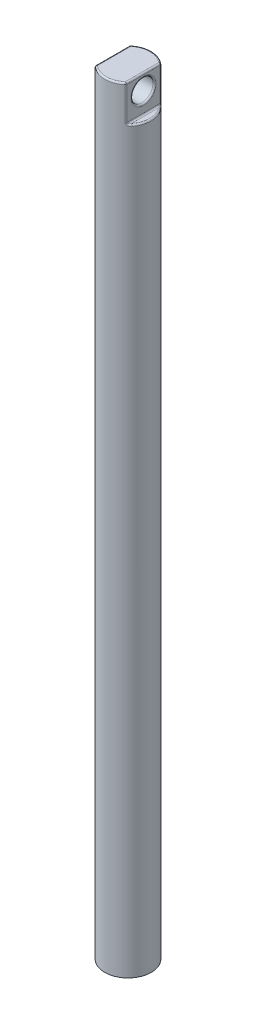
ISO-10303-21;
HEADER;
FILE_DESCRIPTION(('STEP AP214'),'2;1');
FILE_NAME('part.step','',(''),(''),'','','');
FILE_SCHEMA(('AUTOMOTIVE_DESIGN { 1 0 10303 214 1 1 1 1 }'));
ENDSEC;
DATA;
#1=APPLICATION_CONTEXT('core data for automotive mechanical design processes');
#2=APPLICATION_PROTOCOL_DEFINITION('international standard','automotive_design',2000,#1);
#3=PRODUCT_CONTEXT('',#1,'mechanical');
#4=PRODUCT('Part','Part','',(#3));
#5=PRODUCT_RELATED_PRODUCT_CATEGORY('part','',(#4));
#6=PRODUCT_DEFINITION_FORMATION('','',#4);
#7=PRODUCT_DEFINITION_CONTEXT('part definition',#1,'design');
#8=PRODUCT_DEFINITION('design','',#6,#7);
#9=PRODUCT_DEFINITION_SHAPE('','',#8);
#10=(LENGTH_UNIT() NAMED_UNIT(*) SI_UNIT(.MILLI.,.METRE.));
#11=(NAMED_UNIT(*) PLANE_ANGLE_UNIT() SI_UNIT($,.RADIAN.));
#12=(NAMED_UNIT(*) SI_UNIT($,.STERADIAN.) SOLID_ANGLE_UNIT());
#13=UNCERTAINTY_MEASURE_WITH_UNIT(LENGTH_MEASURE(1.E-05),#10,'distance_accuracy_value','');
#14=(GEOMETRIC_REPRESENTATION_CONTEXT(3) GLOBAL_UNCERTAINTY_ASSIGNED_CONTEXT((#13)) GLOBAL_UNIT_ASSIGNED_CONTEXT((#10,
#11,#12)) REPRESENTATION_CONTEXT('',''));
#15=CARTESIAN_POINT('',(0.,0.,0.));
#16=DIRECTION('',(0.,0.,1.));
#17=DIRECTION('',(1.,0.,0.));
#18=AXIS2_PLACEMENT_3D('',#15,#16,#17);
#19=CARTESIAN_POINT('',(0.,150.,0.));
#20=DIRECTION('',(0.,-1.,0.));
#21=DIRECTION('',(0.,0.,-1.));
#22=AXIS2_PLACEMENT_3D('',#19,#20,#21);
#23=CYLINDRICAL_SURFACE('',#22,4.5);
#24=CARTESIAN_POINT('',(0.,0.,0.));
#25=DIRECTION('',(0.,1.,0.));
#26=DIRECTION('',(0.,0.,1.));
#27=AXIS2_PLACEMENT_3D('',#24,#25,#26);
#28=CIRCLE('',#27,4.5);
#29=CARTESIAN_POINT('',(0.,0.,4.5));
#30=VERTEX_POINT('',#29);
#31=EDGE_CURVE('E168',#30,#30,#28,.T.);
#32=ORIENTED_EDGE('',*,*,#31,.T.);
#33=EDGE_LOOP('',(#32));
#34=FACE_BOUND('',#33,.T.);
#35=CARTESIAN_POINT('',(-3.01101468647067,143.380544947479,3.19852404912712));
#36=CARTESIAN_POINT('',(-3.01964309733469,143.411502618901,3.33917851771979));
#37=CARTESIAN_POINT('',(-2.91646004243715,143.461089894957,3.4269900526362));
#38=CARTESIAN_POINT('',(-3.00740278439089,143.367671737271,3.20466106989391));
#39=CARTESIAN_POINT('',(-3.01320259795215,143.393908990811,3.34505281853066));
#40=CARTESIAN_POINT('',(-2.90872025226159,143.435343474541,3.43356543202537));
#41=CARTESIAN_POINT('',(-3.0046479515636,143.354375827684,3.20931776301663));
#42=CARTESIAN_POINT('',(-3.0082875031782,143.375531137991,3.3495166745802));
#43=CARTESIAN_POINT('',(-2.90281703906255,143.408751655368,3.43855474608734));
#44=CARTESIAN_POINT('',(-3.00094905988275,143.327386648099,3.2155541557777));
#45=CARTESIAN_POINT('',(-3.00169709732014,143.338118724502,3.35548930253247));
#46=CARTESIAN_POINT('',(-2.89489084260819,143.354773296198,3.44523659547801));
#47=CARTESIAN_POINT('',(-3.00000143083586,143.313694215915,3.21713992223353));
#48=CARTESIAN_POINT('',(-3.00000315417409,143.31905194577,3.35701503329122));
#49=CARTESIAN_POINT('',(-2.89286020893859,143.327388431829,3.44693563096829));
#50=CARTESIAN_POINT('',(-2.99999855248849,143.286146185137,3.21714327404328));
#51=CARTESIAN_POINT('',(-2.9999968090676,143.280726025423,3.35701961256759));
#52=CARTESIAN_POINT('',(-2.89285404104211,143.272292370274,3.44693922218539));
#53=CARTESIAN_POINT('',(-3.00096548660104,143.272290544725,3.21552372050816));
#54=CARTESIAN_POINT('',(-3.00172405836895,143.261429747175,3.3554627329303));
#55=CARTESIAN_POINT('',(-2.89492604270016,143.244581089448,3.44520398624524));
#56=CARTESIAN_POINT('',(-3.00475793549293,143.245033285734,3.20913526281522));
#57=CARTESIAN_POINT('',(-3.00848625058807,143.22365282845,3.34933885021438));
#58=CARTESIAN_POINT('',(-2.90305271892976,143.19006657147,3.43835921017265));
#59=CARTESIAN_POINT('',(-3.00758284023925,143.231631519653,3.20436739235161));
#60=CARTESIAN_POINT('',(-3.01353305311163,143.205137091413,3.34476108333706));
#61=CARTESIAN_POINT('',(-2.90910608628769,143.163263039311,3.43325077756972));
#62=CARTESIAN_POINT('',(-3.01488489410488,143.205713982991,3.19193448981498));
#63=CARTESIAN_POINT('',(-3.02656015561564,143.169646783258,3.33285875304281));
#64=CARTESIAN_POINT('',(-2.92475334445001,143.111427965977,3.41992981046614));
#65=CARTESIAN_POINT('',(-3.01935454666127,143.193194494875,3.18428259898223));
#66=CARTESIAN_POINT('',(-3.03455051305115,143.152638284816,3.3255250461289));
#67=CARTESIAN_POINT('',(-2.93433117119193,143.086388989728,3.41173135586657));
#68=CARTESIAN_POINT('',(-3.02968582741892,143.169227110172,3.16639516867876));
#69=CARTESIAN_POINT('',(-3.05300037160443,143.120504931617,3.30843360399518));
#70=CARTESIAN_POINT('',(-2.95646962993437,143.038454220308,3.39256625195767));
#71=CARTESIAN_POINT('',(-3.03555001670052,143.157781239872,3.15615487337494));
#72=CARTESIAN_POINT('',(-3.06349417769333,143.105366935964,3.29864305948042));
#73=CARTESIAN_POINT('',(-2.96903574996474,143.015562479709,3.38159450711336));
#74=CARTESIAN_POINT('',(-3.05557971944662,143.124027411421,3.12068468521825));
#75=CARTESIAN_POINT('',(-3.09944583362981,143.061429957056,3.26470686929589));
#76=CARTESIAN_POINT('',(-3.0119565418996,142.948054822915,3.34359073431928));
#77=CARTESIAN_POINT('',(-3.07169835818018,143.103875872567,3.09149266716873));
#78=CARTESIAN_POINT('',(-3.12845061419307,143.036613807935,3.23679975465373));
#79=CARTESIAN_POINT('',(-3.04649648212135,142.907751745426,3.31231357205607));
#80=CARTESIAN_POINT('',(-3.10244602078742,143.073426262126,3.03364220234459));
#81=CARTESIAN_POINT('',(-3.18339912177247,143.002140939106,3.18225387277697));
#82=CARTESIAN_POINT('',(-3.11238433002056,142.846852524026,3.25033093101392));
#83=CARTESIAN_POINT('',(-3.11660417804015,143.061932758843,3.00631971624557));
#84=CARTESIAN_POINT('',(-3.20883749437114,142.990337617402,3.1564461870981));
#85=CARTESIAN_POINT('',(-3.14272323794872,142.823865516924,3.22105683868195));
#86=CARTESIAN_POINT('',(-3.14568557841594,143.042131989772,2.94845632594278));
#87=CARTESIAN_POINT('',(-3.26097726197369,142.972604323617,3.10221337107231));
#88=CARTESIAN_POINT('',(-3.20504052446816,142.784263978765,3.15906034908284));
#89=CARTESIAN_POINT('',(-3.16061286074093,143.03384402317,2.91789729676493));
#90=CARTESIAN_POINT('',(-3.28779196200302,142.966814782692,3.07363336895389));
#91=CARTESIAN_POINT('',(-3.23702755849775,142.767688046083,3.12631853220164));
#92=CARTESIAN_POINT('',(-3.19715667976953,143.017175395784,2.84062021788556));
#93=CARTESIAN_POINT('',(-3.35361273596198,142.95934765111,3.00159993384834));
#94=CARTESIAN_POINT('',(-3.31533574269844,142.734350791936,3.04352166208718));
#95=CARTESIAN_POINT('',(-3.21882935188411,143.010355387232,2.79270379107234));
#96=CARTESIAN_POINT('',(-3.39246658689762,142.961008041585,2.957387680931));
#97=CARTESIAN_POINT('',(-3.3617771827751,142.720710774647,2.992182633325));
#98=CARTESIAN_POINT('',(-3.2611600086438,143.001768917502,2.69461491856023));
#99=CARTESIAN_POINT('',(-3.46795767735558,142.974088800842,2.86834523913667));
#100=CARTESIAN_POINT('',(-3.45248573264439,142.703537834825,2.8870874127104));
#101=CARTESIAN_POINT('',(-3.28182842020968,142.999927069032,2.64448794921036));
#102=CARTESIAN_POINT('',(-3.50477461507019,142.985846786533,2.8232054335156));
#103=CARTESIAN_POINT('',(-3.49677518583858,142.699854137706,2.83337994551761));
#104=CARTESIAN_POINT('',(-3.30172932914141,143.00000498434,2.59367709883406));
#105=CARTESIAN_POINT('',(-3.53875749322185,143.001371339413,2.77978354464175));
#106=CARTESIAN_POINT('',(-3.53941999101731,142.70000996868,2.77893974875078));
#107=(BOUNDED_SURFACE() B_SPLINE_SURFACE(3,2,((#35,#36,#37),(#38,#39,#40),(#41,#42,#43),(#44,
#45,#46),(#47,#48,#49),(#50,#51,#52),(#53,#54,#55),(#56,#57,#58),(#59,#60,#61),(#62,#63,#64),
(#65,#66,#67),(#68,#69,#70),(#71,#72,#73),(#74,#75,#76),(#77,#78,#79),(#80,#81,#82),(#83,#84,
#85),(#86,#87,#88),(#89,#90,#91),(#92,#93,#94),(#95,#96,#97),(#98,#99,#100),(#101,#102,#103),
(#104,#105,#106)),.UNSPECIFIED.,.F.,.F.,.F.) B_SPLINE_SURFACE_WITH_KNOTS((4,2,2,2,2,2,2,2,2,2,2,
4),(3,3),(0.,0.0822243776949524,0.164286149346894,0.247304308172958,0.330295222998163,
0.412912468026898,0.495682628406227,0.670954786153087,0.807095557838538,0.944043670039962,
1.14118972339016,1.33533309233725),(0.,1.),
.UNSPECIFIED.) GEOMETRIC_REPRESENTATION_ITEM() RATIONAL_B_SPLINE_SURFACE(((1.,0.90119552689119,
1.),(1.,0.902894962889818,1.),(1.,0.904178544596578,1.),(1.,0.905893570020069,1.),(1.,
0.906326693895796,1.),(1.,0.906327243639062,1.),(1.,0.905884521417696,1.),(1.,0.904129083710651,
1.),(1.,0.902816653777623,1.),(1.,0.899367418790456,1.),(1.,0.89723435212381,1.),(1.,
0.892198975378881,1.),(1.,0.889295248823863,1.),(1.,0.879119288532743,1.),(1.,0.870591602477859,
1.),(1.,0.853189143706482,1.),(1.,0.844816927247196,1.),(1.,0.826698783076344,1.),(1.,
0.816945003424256,1.),(1.,0.791749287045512,1.),(1.,0.775691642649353,1.),(1.,0.741833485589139,
1.),(1.,0.724063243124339,1.),(1.,0.70550196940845,1.))) REPRESENTATION_ITEM('') SURFACE());
#108=CARTESIAN_POINT('',(-3.53941999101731,142.70000996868,2.77893974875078));
#109=CARTESIAN_POINT('',(-3.49677518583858,142.699854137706,2.83337994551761));
#110=CARTESIAN_POINT('',(-3.45248573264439,142.703537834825,2.8870874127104));
#111=CARTESIAN_POINT('',(-3.3617771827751,142.720710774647,2.992182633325));
#112=CARTESIAN_POINT('',(-3.31533574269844,142.734350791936,3.04352166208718));
#113=CARTESIAN_POINT('',(-3.23702755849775,142.767688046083,3.12631853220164));
#114=CARTESIAN_POINT('',(-3.20504052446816,142.784263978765,3.15906034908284));
#115=CARTESIAN_POINT('',(-3.14272323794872,142.823865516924,3.22105683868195));
#116=CARTESIAN_POINT('',(-3.11238433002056,142.846852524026,3.25033093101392));
#117=CARTESIAN_POINT('',(-3.04649648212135,142.907751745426,3.31231357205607));
#118=CARTESIAN_POINT('',(-3.0119565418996,142.948054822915,3.34359073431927));
#119=CARTESIAN_POINT('',(-2.96903574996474,143.015562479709,3.38159450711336));
#120=CARTESIAN_POINT('',(-2.95646962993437,143.038454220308,3.39256625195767));
#121=CARTESIAN_POINT('',(-2.93433117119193,143.086388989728,3.41173135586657));
#122=CARTESIAN_POINT('',(-2.92475334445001,143.111427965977,3.41992981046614));
#123=CARTESIAN_POINT('',(-2.90910608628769,143.163263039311,3.43325077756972));
#124=CARTESIAN_POINT('',(-2.90305271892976,143.19006657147,3.43835921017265));
#125=CARTESIAN_POINT('',(-2.89492604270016,143.244581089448,3.44520398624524));
#126=CARTESIAN_POINT('',(-2.89285404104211,143.272292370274,3.44693922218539));
#127=CARTESIAN_POINT('',(-2.89286020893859,143.327388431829,3.44693563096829));
#128=CARTESIAN_POINT('',(-2.89489084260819,143.354773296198,3.44523659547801));
#129=CARTESIAN_POINT('',(-2.90281703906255,143.408751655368,3.43855474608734));
#130=CARTESIAN_POINT('',(-2.90872025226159,143.435343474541,3.43356543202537));
#131=CARTESIAN_POINT('',(-2.91646004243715,143.461089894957,3.4269900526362));
#132=B_SPLINE_CURVE_WITH_KNOTS('',3,(#108,#109,#110,#111,#112,#113,#114,#115,#116,#117,#118,
#119,#120,#121,#122,#123,#124,#125,#126,#127,#128,#129,#130,#131),.UNSPECIFIED.,.F.,.F.,(4,2,2,
2,2,2,2,2,2,2,2,4),(0.,0.194143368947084,0.391289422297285,0.52823753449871,0.66437830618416,
0.83965046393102,0.922420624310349,1.00503786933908,1.08802878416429,1.17104694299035,
1.2531087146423,1.33533309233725),.UNSPECIFIED.);
#133=CARTESIAN_POINT('',(-3.53571428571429,142.7,2.78365308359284));
#134=VERTEX_POINT('',#133);
#135=CARTESIAN_POINT('',(-2.89285714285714,143.3,3.44693741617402));
#136=VERTEX_POINT('',#135);
#137=EDGE_CURVE('E253',#134,#136,#132,.T.);
#138=ORIENTED_EDGE('',*,*,#137,.F.);
#139=CARTESIAN_POINT('',(0.,142.7,0.));
#140=DIRECTION('',(0.,1.,0.));
#141=DIRECTION('',(0.,0.,1.));
#142=AXIS2_PLACEMENT_3D('',#139,#140,#141);
#143=CIRCLE('',#142,4.5);
#144=CARTESIAN_POINT('',(-3.53571428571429,142.7,-2.78365308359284));
#145=VERTEX_POINT('',#144);
#146=EDGE_CURVE('E245',#134,#145,#143,.F.);
#147=ORIENTED_EDGE('',*,*,#146,.T.);
#148=CARTESIAN_POINT('',(-3.45269728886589,143.041768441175,-2.15432818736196));
#149=CARTESIAN_POINT('',(-3.57017196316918,143.111233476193,-2.24906683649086));
#150=CARTESIAN_POINT('',(-3.70418020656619,143.026877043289,-2.29933496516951));
#151=CARTESIAN_POINT('',(-3.83818844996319,142.942520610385,-2.34960309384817));
#152=CARTESIAN_POINT('',(-3.86292276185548,142.783536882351,-2.30820877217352));
#153=CARTESIAN_POINT('',(-3.44162108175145,143.035229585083,-2.19140921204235));
#154=CARTESIAN_POINT('',(-3.5595557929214,143.098196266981,-2.28370979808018));
#155=CARTESIAN_POINT('',(-3.68795283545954,143.012528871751,-2.33449666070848));
#156=CARTESIAN_POINT('',(-3.81652538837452,142.927010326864,-2.38490945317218));
#157=CARTESIAN_POINT('',(-3.83918803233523,142.770459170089,-2.34793844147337));
#158=CARTESIAN_POINT('',(-3.43014425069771,143.0293941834,-2.22851696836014));
#159=CARTESIAN_POINT('',(-3.54789293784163,143.085898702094,-2.31884590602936));
#160=CARTESIAN_POINT('',(-3.670796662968,142.999245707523,-2.3699576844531));
#161=CARTESIAN_POINT('',(-3.79387782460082,142.91271066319,-2.42072024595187));
#162=CARTESIAN_POINT('',(-3.81459482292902,142.758788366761,-2.38769675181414));
#163=CARTESIAN_POINT('',(-3.40640555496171,143.019203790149,-2.30262658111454));
#164=CARTESIAN_POINT('',(-3.52272431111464,143.063171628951,-2.38940435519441));
#165=CARTESIAN_POINT('',(-3.63474222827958,142.974991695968,-2.44119199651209));
#166=CARTESIAN_POINT('',(-3.74693407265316,142.886930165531,-2.49263466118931));
#167=CARTESIAN_POINT('',(-3.76372618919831,142.738407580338,-2.4670999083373));
#168=CARTESIAN_POINT('',(-3.3941424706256,143.014851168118,-2.33962817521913));
#169=CARTESIAN_POINT('',(-3.509224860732,143.052719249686,-2.42484846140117));
#170=CARTESIAN_POINT('',(-3.61584123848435,142.964024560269,-2.47696569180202));
#171=CARTESIAN_POINT('',(-3.72263520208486,142.875417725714,-2.52876045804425));
#172=CARTESIAN_POINT('',(-3.73744815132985,142.729702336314,-2.50674447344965));
#173=CARTESIAN_POINT('',(-3.36863950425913,143.007652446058,-2.41395623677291));
#174=CARTESIAN_POINT('',(-3.48029018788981,143.033743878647,-2.49630499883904));
#175=CARTESIAN_POINT('',(-3.57608573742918,142.944444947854,-2.54911359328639));
#176=CARTESIAN_POINT('',(-3.67206448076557,142.855235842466,-2.60158991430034));
#177=CARTESIAN_POINT('',(-3.68279893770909,142.715304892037,-2.5863816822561));
#178=CARTESIAN_POINT('',(-3.35538535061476,143.004837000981,-2.45127521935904));
#179=CARTESIAN_POINT('',(-3.46482662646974,143.025234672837,-2.53234479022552));
#180=CARTESIAN_POINT('',(-3.55520059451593,142.935881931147,-2.58548608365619));
#181=CARTESIAN_POINT('',(-3.64575737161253,142.846589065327,-2.63832144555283));
#182=CARTESIAN_POINT('',(-3.65439717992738,142.709674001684,-2.62636630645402));
#183=CARTESIAN_POINT('',(-3.32818954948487,143.001012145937,-2.52523797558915));
#184=CARTESIAN_POINT('',(-3.43236591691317,143.010704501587,-2.60396521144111));
#185=CARTESIAN_POINT('',(-3.51198028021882,142.921706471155,-2.65779173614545));
#186=CARTESIAN_POINT('',(-3.591776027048,142.83276801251,-2.71131491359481));
#187=CARTESIAN_POINT('',(-3.5961204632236,142.702024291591,-2.70561211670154));
#188=CARTESIAN_POINT('',(-3.31424834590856,143.000001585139,-2.56188216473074));
#189=CARTESIAN_POINT('',(-3.41537299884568,143.004656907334,-2.63957103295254));
#190=CARTESIAN_POINT('',(-3.48964604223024,142.916092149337,-2.69372516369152));
#191=CARTESIAN_POINT('',(-3.56409819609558,142.827558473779,-2.74760253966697));
#192=CARTESIAN_POINT('',(-3.56624645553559,142.70000317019,-2.74487374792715));
#193=CARTESIAN_POINT('',(-3.27769618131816,142.999997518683,-2.65473299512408));
#194=CARTESIAN_POINT('',(-3.3701448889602,142.992782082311,-2.7297716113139));
#195=CARTESIAN_POINT('',(-3.43071744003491,142.905933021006,-2.78498461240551));
#196=CARTESIAN_POINT('',(-3.49172098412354,142.819157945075,-2.83952919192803));
#197=CARTESIAN_POINT('',(-3.4879203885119,142.699995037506,-2.84435678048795));
#198=CARTESIAN_POINT('',(-3.25463975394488,143.002467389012,-2.71028676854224));
#199=CARTESIAN_POINT('',(-3.34083029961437,142.988896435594,-2.78411170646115));
#200=CARTESIAN_POINT('',(-3.39319972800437,142.903787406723,-2.83978891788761));
#201=CARTESIAN_POINT('',(-3.44597405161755,142.818647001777,-2.89490804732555));
#202=CARTESIAN_POINT('',(-3.43851375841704,142.704934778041,-2.90387868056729));
#203=CARTESIAN_POINT('',(-3.20786042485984,143.013500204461,-2.81731409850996));
#204=CARTESIAN_POINT('',(-3.28029388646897,142.989795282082,-2.88896511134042));
#205=CARTESIAN_POINT('',(-3.3166084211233,142.909525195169,-2.94563792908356));
#206=CARTESIAN_POINT('',(-3.35331311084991,142.829226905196,-3.00177009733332));
#207=CARTESIAN_POINT('',(-3.33827233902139,142.727000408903,-3.01855081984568));
#208=CARTESIAN_POINT('',(-3.1841437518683,143.022017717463,-2.86881491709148));
#209=CARTESIAN_POINT('',(-3.24906655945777,142.994428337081,-2.93961297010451));
#210=CARTESIAN_POINT('',(-3.27754846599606,142.917334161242,-2.99670755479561));
#211=CARTESIAN_POINT('',(-3.30635995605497,142.840121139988,-3.05339034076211));
#212=CARTESIAN_POINT('',(-3.28745089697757,142.744035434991,-3.07373026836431));
#213=CARTESIAN_POINT('',(-3.14749570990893,143.041220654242,-2.94474313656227));
#214=CARTESIAN_POINT('',(-3.20022471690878,143.009968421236,-3.01446155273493));
#215=CARTESIAN_POINT('',(-3.21698372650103,142.939114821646,-3.07214019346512));
#216=CARTESIAN_POINT('',(-3.23385110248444,142.868222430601,-3.12968460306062));
#217=CARTESIAN_POINT('',(-3.20891937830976,142.782441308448,-3.15508193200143));
#218=CARTESIAN_POINT('',(-3.13432552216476,143.049385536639,-2.9712651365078));
#219=CARTESIAN_POINT('',(-3.18258635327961,143.017271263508,-3.04060120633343));
#220=CARTESIAN_POINT('',(-3.19517517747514,142.948974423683,-3.09851981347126));
#221=CARTESIAN_POINT('',(-3.20785528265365,142.880625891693,-3.15633100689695));
#222=CARTESIAN_POINT('',(-3.18069754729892,142.798771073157,-3.18349836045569));
#223=CARTESIAN_POINT('',(-3.10865119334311,143.068396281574,-3.02169341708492));
#224=CARTESIAN_POINT('',(-3.14805487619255,143.035621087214,-3.09032197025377));
#225=CARTESIAN_POINT('',(-3.15260550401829,142.973040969,-3.14872397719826));
#226=CARTESIAN_POINT('',(-3.1572457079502,142.910410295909,-3.2070201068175));
#227=CARTESIAN_POINT('',(-3.12568112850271,142.836792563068,-3.23752866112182));
#228=CARTESIAN_POINT('',(-3.09614664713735,143.079240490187,-3.04560129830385));
#229=CARTESIAN_POINT('',(-3.13114761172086,143.046655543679,-3.11393064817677));
#230=CARTESIAN_POINT('',(-3.13184374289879,142.987245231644,-3.17255008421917));
#231=CARTESIAN_POINT('',(-3.13260981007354,142.927776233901,-3.23109088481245));
#232=CARTESIAN_POINT('',(-3.09888567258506,142.858480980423,-3.2631442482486));
#233=CARTESIAN_POINT('',(-3.07452430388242,143.101610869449,-3.08603989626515));
#234=CARTESIAN_POINT('',(-3.10182211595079,143.070389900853,-3.15388166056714));
#235=CARTESIAN_POINT('',(-3.09591546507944,143.017338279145,-3.21288166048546));
#236=CARTESIAN_POINT('',(-3.09005670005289,142.964246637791,-3.27182801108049));
#237=CARTESIAN_POINT('',(-3.05255207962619,142.903221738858,-3.30647131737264));
#238=CARTESIAN_POINT('',(-3.06519783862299,143.112680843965,-3.10312836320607));
#239=CARTESIAN_POINT('',(-3.08913451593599,143.082445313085,-3.17077828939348));
#240=CARTESIAN_POINT('',(-3.08040740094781,143.032490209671,-3.22993746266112));
#241=CARTESIAN_POINT('',(-3.0717152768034,142.982494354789,-3.28905876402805));
#242=CARTESIAN_POINT('',(-3.03256679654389,142.925361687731,-3.3247803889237));
#243=CARTESIAN_POINT('',(-3.04788497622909,143.136731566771,-3.13435993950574));
#244=CARTESIAN_POINT('',(-3.06554755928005,143.109198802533,-3.20166030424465));
#245=CARTESIAN_POINT('',(-3.05160893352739,143.06587077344,-3.26112604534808));
#246=CARTESIAN_POINT('',(-3.03770503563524,143.0225026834,-3.32055415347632));
#247=CARTESIAN_POINT('',(-2.99546780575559,142.973463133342,-3.35824279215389));
#248=CARTESIAN_POINT('',(-3.03989604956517,143.149708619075,-3.14850862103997));
#249=CARTESIAN_POINT('',(-3.05463446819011,143.123892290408,-3.21566613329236));
#250=CARTESIAN_POINT('',(-3.03831434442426,143.084093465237,-3.27526435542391));
#251=CARTESIAN_POINT('',(-3.02201600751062,143.044258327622,-3.3348396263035));
#252=CARTESIAN_POINT('',(-2.97834867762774,142.999417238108,-3.37340209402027));
#253=CARTESIAN_POINT('',(-3.02689023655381,143.17517443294,-3.17126850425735));
#254=CARTESIAN_POINT('',(-3.03685280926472,143.153117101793,-3.23819613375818));
#255=CARTESIAN_POINT('',(-3.0166672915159,143.120172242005,-3.29801678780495));
#256=CARTESIAN_POINT('',(-2.99649727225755,143.087201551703,-3.3578211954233));
#257=CARTESIAN_POINT('',(-2.95047907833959,143.050348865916,-3.39778768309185));
#258=CARTESIAN_POINT('',(-3.02160207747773,143.18740675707,-3.18040413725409));
#259=CARTESIAN_POINT('',(-3.02961170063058,143.167294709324,-3.24724551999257));
#260=CARTESIAN_POINT('',(-3.00786399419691,143.137616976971,-3.30715347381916));
#261=CARTESIAN_POINT('',(-2.98612473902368,143.107918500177,-3.36705271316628));
#262=CARTESIAN_POINT('',(-2.93914730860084,143.07481351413,-3.40757586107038));
#263=CARTESIAN_POINT('',(-3.01262240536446,143.212848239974,-3.19580680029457));
#264=CARTESIAN_POINT('',(-3.01731297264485,143.196990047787,-3.26249978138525));
#265=CARTESIAN_POINT('',(-2.99291443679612,143.174072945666,-3.32256163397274));
#266=CARTESIAN_POINT('',(-2.9685243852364,143.151135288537,-3.38261474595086));
#267=CARTESIAN_POINT('',(-2.91990515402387,143.125696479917,-3.42407871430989));
#268=CARTESIAN_POINT('',(-3.00892748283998,143.226055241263,-3.20207995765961));
#269=CARTESIAN_POINT('',(-3.0122455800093,143.212509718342,-3.26871722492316));
#270=CARTESIAN_POINT('',(-2.98676250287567,143.193080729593,-3.32883922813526));
#271=CARTESIAN_POINT('',(-2.96128251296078,143.17363849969,-3.38895808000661));
#272=CARTESIAN_POINT('',(-2.91198746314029,143.152110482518,-3.43079995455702));
#273=CARTESIAN_POINT('',(-3.00335025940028,143.253186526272,-3.21151480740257));
#274=CARTESIAN_POINT('',(-3.00459795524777,143.244512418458,-3.2780650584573));
#275=CARTESIAN_POINT('',(-2.97747644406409,143.232232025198,-3.3382818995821));
#276=CARTESIAN_POINT('',(-2.9503581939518,143.219938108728,-3.39849543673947));
#277=CARTESIAN_POINT('',(-2.90003627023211,143.206373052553,-3.44090872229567));
#278=CARTESIAN_POINT('',(-3.00147651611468,143.267113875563,-3.21466181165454));
#279=CARTESIAN_POINT('',(-3.00202595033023,143.261006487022,-3.28118520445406));
#280=CARTESIAN_POINT('',(-2.97435656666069,143.252380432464,-3.34143228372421));
#281=CARTESIAN_POINT('',(-2.94668752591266,143.243750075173,-3.40167900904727));
#282=CARTESIAN_POINT('',(-2.89602110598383,143.234227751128,-3.44428051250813));
#283=CARTESIAN_POINT('',(-2.9997084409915,143.295196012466,-3.21763166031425));
#284=CARTESIAN_POINT('',(-2.99960011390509,143.294295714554,-3.28412835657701));
#285=CARTESIAN_POINT('',(-2.97141262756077,143.293038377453,-3.34440531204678));
#286=CARTESIAN_POINT('',(-2.94322542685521,143.291776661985,-3.40468198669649));
#287=CARTESIAN_POINT('',(-2.89223237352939,143.290392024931,-3.4474624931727));
#288=CARTESIAN_POINT('',(-2.99981555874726,143.309350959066,-3.21745207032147));
#289=CARTESIAN_POINT('',(-2.99974711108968,143.311098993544,-3.28395035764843));
#290=CARTESIAN_POINT('',(-2.97159097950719,143.313548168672,-3.34422551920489));
#291=CARTESIAN_POINT('',(-2.94343517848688,143.316002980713,-3.40450036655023));
#292=CARTESIAN_POINT('',(-2.89246191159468,143.318701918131,-3.4472700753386));
#293=CARTESIAN_POINT('',(-3.00192472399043,143.336327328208,-3.21390839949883));
#294=CARTESIAN_POINT('',(-3.0026409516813,143.343067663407,-3.28043847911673));
#295=CARTESIAN_POINT('',(-2.9751028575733,143.352597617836,-3.34067808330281));
#296=CARTESIAN_POINT('',(-2.94756531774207,143.36213192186,-3.40091710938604));
#297=CARTESIAN_POINT('',(-2.89698155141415,143.372654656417,-3.44347328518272));
#298=CARTESIAN_POINT('',(-3.00378295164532,143.349168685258,-3.21078601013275));
#299=CARTESIAN_POINT('',(-3.00519166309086,143.358267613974,-3.2773426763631));
#300=CARTESIAN_POINT('',(-2.9781969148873,143.371169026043,-3.33755238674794));
#301=CARTESIAN_POINT('',(-2.95120577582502,143.384081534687,-3.39775838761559));
#302=CARTESIAN_POINT('',(-2.90096346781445,143.398337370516,-3.44012786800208));
#303=CARTESIAN_POINT('',(-3.00905543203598,143.37428671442,-3.20186021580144));
#304=CARTESIAN_POINT('',(-3.01242036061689,143.387889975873,-3.26850014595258));
#305=CARTESIAN_POINT('',(-2.98697549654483,143.407410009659,-3.32861941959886));
#306=CARTESIAN_POINT('',(-2.96153270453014,143.42694240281,-3.38873662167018));
#307=CARTESIAN_POINT('',(-2.91226164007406,143.44857342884,-3.43056451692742));
#308=CARTESIAN_POINT('',(-3.01246950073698,143.38656345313,-3.19605712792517));
#309=CARTESIAN_POINT('',(-3.01710090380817,143.402317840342,-3.26275026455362));
#310=CARTESIAN_POINT('',(-2.99265971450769,143.425079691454,-3.32281246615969));
#311=CARTESIAN_POINT('',(-2.96822283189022,143.447861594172,-3.38287036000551));
#312=CARTESIAN_POINT('',(-2.91957750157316,143.47312690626,-3.42434692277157));
#313=CARTESIAN_POINT('',(-3.01659468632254,143.398394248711,-3.18899292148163));
#314=CARTESIAN_POINT('',(-3.02274997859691,143.416123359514,-3.25575588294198));
#315=CARTESIAN_POINT('',(-2.99952757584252,143.442036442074,-3.31574533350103));
#316=CARTESIAN_POINT('',(-2.97630517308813,143.467949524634,-3.37573478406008));
#317=CARTESIAN_POINT('',(-2.92841718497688,143.496788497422,-3.41677813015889));
#318=(BOUNDED_SURFACE() B_SPLINE_SURFACE(3,2,((#148,#149,#150,#151,#152),(#153,#154,#155,#156,
#157),(#158,#159,#160,#161,#162),(#163,#164,#165,#166,#167),(#168,#169,#170,#171,#172),(#173,
#174,#175,#176,#177),(#178,#179,#180,#181,#182),(#183,#184,#185,#186,#187),(#188,#189,#190,#191,
#192),(#193,#194,#195,#196,#197),(#198,#199,#200,#201,#202),(#203,#204,#205,#206,#207),(#208,
#209,#210,#211,#212),(#213,#214,#215,#216,#217),(#218,#219,#220,#221,#222),(#223,#224,#225,#226,
#227),(#228,#229,#230,#231,#232),(#233,#234,#235,#236,#237),(#238,#239,#240,#241,#242),(#243,
#244,#245,#246,#247),(#248,#249,#250,#251,#252),(#253,#254,#255,#256,#257),(#258,#259,#260,#261,
#262),(#263,#264,#265,#266,#267),(#268,#269,#270,#271,#272),(#273,#274,#275,#276,#277),(#278,
#279,#280,#281,#282),(#283,#284,#285,#286,#287),(#288,#289,#290,#291,#292),(#293,#294,#295,#296,
#297),(#298,#299,#300,#301,#302),(#303,#304,#305,#306,#307),(#308,#309,#310,#311,#312),(#313,
#314,#315,#316,#317)),.UNSPECIFIED.,.F.,.F.,.F.) B_SPLINE_SURFACE_WITH_KNOTS((4,2,2,2,2,2,2,2,2,
2,2,2,2,2,2,2,4),(3,2,3),(0.,0.135372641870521,0.270960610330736,0.409162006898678,
0.547275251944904,0.763472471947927,0.978062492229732,1.10007511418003,1.22201260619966,
1.32248203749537,1.42275926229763,1.5069279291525,1.59091557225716,1.67529598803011,
1.75973815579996,1.83779866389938,1.91584994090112),(0.,0.5,1.),
.UNSPECIFIED.) GEOMETRIC_REPRESENTATION_ITEM() RATIONAL_B_SPLINE_SURFACE(((1.,0.874813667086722,
1.,0.874813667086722,1.),(1.,0.879441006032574,1.,0.879441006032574,1.),(1.,0.883911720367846,
1.,0.883911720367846,1.),(1.,0.892567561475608,1.,0.892567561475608,1.),(1.,0.89675222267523,1.,
0.89675222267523,1.),(1.,0.904927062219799,1.,0.904927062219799,1.),(1.,0.908911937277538,1.,
0.908911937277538,1.),(1.,0.916603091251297,1.,0.916603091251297,1.),(1.,0.920309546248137,1.,
0.920309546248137,1.),(1.,0.929467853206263,1.,0.929467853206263,1.),(1.,0.934721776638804,1.,
0.934721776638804,1.),(1.,0.94447391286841,1.,0.94447391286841,1.),(1.,0.948977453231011,1.,
0.948977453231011,1.),(1.,0.955385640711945,1.,0.955385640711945,1.),(1.,0.957573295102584,1.,
0.957573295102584,1.),(1.,0.961650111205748,1.,0.961650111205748,1.),(1.,0.96353945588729,1.,
0.96353945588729,1.),(1.,0.966675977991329,1.,0.966675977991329,1.),(1.,0.967977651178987,1.,
0.967977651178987,1.),(1.,0.970323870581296,1.,0.970323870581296,1.),(1.,0.971368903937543,1.,
0.971368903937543,1.),(1.,0.973031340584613,1.,0.973031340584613,1.),(1.,0.973690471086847,1.,
0.973690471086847,1.),(1.,0.974794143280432,1.,0.974794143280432,1.),(1.,0.975239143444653,1.,
0.975239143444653,1.),(1.,0.975906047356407,1.,0.975906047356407,1.),(1.,0.976126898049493,1.,
0.976126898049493,1.),(1.,0.976335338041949,1.,0.976335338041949,1.),(1.,0.976322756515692,1.,
0.976322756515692,1.),(1.,0.976073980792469,1.,0.976073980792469,1.),(1.,0.975854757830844,1.,
0.975854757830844,1.),(1.,0.975223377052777,1.,0.975223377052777,1.),(1.,0.974811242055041,1.,
0.974811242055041,1.),(1.,0.974305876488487,1.,0.974305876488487,1.))) REPRESENTATION_ITEM('') SURFACE());
#319=CARTESIAN_POINT('',(-2.92841718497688,143.496788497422,-3.41677813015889));
#320=CARTESIAN_POINT('',(-2.91957750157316,143.47312690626,-3.42434692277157));
#321=CARTESIAN_POINT('',(-2.91226164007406,143.44857342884,-3.43056451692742));
#322=CARTESIAN_POINT('',(-2.90096346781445,143.398337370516,-3.44012786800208));
#323=CARTESIAN_POINT('',(-2.89698155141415,143.372654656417,-3.44347328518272));
#324=CARTESIAN_POINT('',(-2.89246191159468,143.318701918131,-3.4472700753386));
#325=CARTESIAN_POINT('',(-2.89223237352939,143.290392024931,-3.4474624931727));
#326=CARTESIAN_POINT('',(-2.89602110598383,143.234227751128,-3.44428051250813));
#327=CARTESIAN_POINT('',(-2.90003627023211,143.206373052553,-3.44090872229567));
#328=CARTESIAN_POINT('',(-2.91198746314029,143.152110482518,-3.43079995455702));
#329=CARTESIAN_POINT('',(-2.91990515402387,143.125696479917,-3.42407871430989));
#330=CARTESIAN_POINT('',(-2.93914730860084,143.07481351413,-3.40757586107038));
#331=CARTESIAN_POINT('',(-2.95047907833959,143.050348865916,-3.39778768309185));
#332=CARTESIAN_POINT('',(-2.97834867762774,142.999417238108,-3.37340209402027));
#333=CARTESIAN_POINT('',(-2.99546780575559,142.973463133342,-3.35824279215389));
#334=CARTESIAN_POINT('',(-3.03256679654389,142.925361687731,-3.3247803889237));
#335=CARTESIAN_POINT('',(-3.05255207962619,142.903221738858,-3.30647131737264));
#336=CARTESIAN_POINT('',(-3.09888567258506,142.858480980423,-3.2631442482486));
#337=CARTESIAN_POINT('',(-3.12568112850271,142.836792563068,-3.23752866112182));
#338=CARTESIAN_POINT('',(-3.18069754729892,142.798771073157,-3.18349836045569));
#339=CARTESIAN_POINT('',(-3.20891937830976,142.782441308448,-3.15508193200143));
#340=CARTESIAN_POINT('',(-3.28745089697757,142.744035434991,-3.07373026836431));
#341=CARTESIAN_POINT('',(-3.33827233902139,142.727000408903,-3.01855081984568));
#342=CARTESIAN_POINT('',(-3.43851375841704,142.704934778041,-2.90387868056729));
#343=CARTESIAN_POINT('',(-3.4879203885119,142.699995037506,-2.84435678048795));
#344=CARTESIAN_POINT('',(-3.56624645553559,142.70000317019,-2.74487374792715));
#345=CARTESIAN_POINT('',(-3.5961204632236,142.702024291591,-2.70561211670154));
#346=CARTESIAN_POINT('',(-3.65439717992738,142.709674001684,-2.62636630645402));
#347=CARTESIAN_POINT('',(-3.68279893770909,142.715304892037,-2.5863816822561));
#348=CARTESIAN_POINT('',(-3.73744815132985,142.729702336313,-2.50674447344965));
#349=CARTESIAN_POINT('',(-3.76372618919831,142.738407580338,-2.4670999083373));
#350=CARTESIAN_POINT('',(-3.81459482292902,142.758788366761,-2.38769675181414));
#351=CARTESIAN_POINT('',(-3.83918803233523,142.770459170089,-2.34793844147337));
#352=CARTESIAN_POINT('',(-3.86292276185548,142.783536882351,-2.30820877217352));
#353=B_SPLINE_CURVE_WITH_KNOTS('',3,(#319,#320,#321,#322,#323,#324,#325,#326,#327,#328,#329,
#330,#331,#332,#333,#334,#335,#336,#337,#338,#339,#340,#341,#342,#343,#344,#345,#346,#347,#348,
#349,#350,#351,#352),.UNSPECIFIED.,.F.,.F.,(4,2,2,2,2,2,2,2,2,2,2,2,2,2,2,2,4),(0.,
0.0780512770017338,0.156111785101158,0.240553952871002,0.324934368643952,0.408922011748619,
0.493090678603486,0.593367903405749,0.693837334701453,0.815774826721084,0.937787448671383,
1.15237746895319,1.36857468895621,1.50668793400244,1.64488933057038,1.78047729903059,
1.91584994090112),.UNSPECIFIED.);
#354=CARTESIAN_POINT('',(-2.89285714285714,143.3,-3.44693741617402));
#355=VERTEX_POINT('',#354);
#356=EDGE_CURVE('E237',#355,#145,#353,.T.);
#357=ORIENTED_EDGE('',*,*,#356,.F.);
#358=DIRECTION('',(0.,-1.,0.));
#359=VECTOR('',#358,1.);
#360=CARTESIAN_POINT('',(-2.89285714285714,150.,-3.44693741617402));
#361=LINE('',#360,#359);
#362=CARTESIAN_POINT('',(-2.89285714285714,149.7,-3.44693741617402));
#363=VERTEX_POINT('',#362);
#364=EDGE_CURVE('E497',#355,#363,#361,.F.);
#365=ORIENTED_EDGE('',*,*,#364,.T.);
#366=CARTESIAN_POINT('',(0.,149.7,0.));
#367=DIRECTION('',(0.,1.,0.));
#368=DIRECTION('',(0.,0.,1.));
#369=AXIS2_PLACEMENT_3D('',#366,#367,#368);
#370=CIRCLE('',#369,4.5);
#371=CARTESIAN_POINT('',(2.89285714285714,149.7,-3.44693741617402));
#372=VERTEX_POINT('',#371);
#373=EDGE_CURVE('E374',#363,#372,#370,.F.);
#374=ORIENTED_EDGE('',*,*,#373,.T.);
#375=DIRECTION('',(0.,-1.,0.));
#376=VECTOR('',#375,1.);
#377=CARTESIAN_POINT('',(2.89285714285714,150.,-3.44693741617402));
#378=LINE('',#377,#376);
#379=CARTESIAN_POINT('',(2.89285714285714,143.3,-3.44693741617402));
#380=VERTEX_POINT('',#379);
#381=EDGE_CURVE('E454',#372,#380,#378,.T.);
#382=ORIENTED_EDGE('',*,*,#381,.T.);
#383=CARTESIAN_POINT('',(3.01101468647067,143.380544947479,-3.19852404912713));
#384=CARTESIAN_POINT('',(3.01964309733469,143.411502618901,-3.33917851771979));
#385=CARTESIAN_POINT('',(2.91646004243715,143.461089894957,-3.42699005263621));
#386=CARTESIAN_POINT('',(3.00740278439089,143.367671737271,-3.20466106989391));
#387=CARTESIAN_POINT('',(3.01320259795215,143.393908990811,-3.34505281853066));
#388=CARTESIAN_POINT('',(2.90872025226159,143.435343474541,-3.43356543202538));
#389=CARTESIAN_POINT('',(3.0046479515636,143.354375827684,-3.20931776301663));
#390=CARTESIAN_POINT('',(3.0082875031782,143.375531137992,-3.3495166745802));
#391=CARTESIAN_POINT('',(2.90281703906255,143.408751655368,-3.43855474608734));
#392=CARTESIAN_POINT('',(3.00094905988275,143.327386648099,-3.2155541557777));
#393=CARTESIAN_POINT('',(3.00169709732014,143.338118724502,-3.35548930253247));
#394=CARTESIAN_POINT('',(2.89489084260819,143.354773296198,-3.44523659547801));
#395=CARTESIAN_POINT('',(3.00000143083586,143.313694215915,-3.21713992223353));
#396=CARTESIAN_POINT('',(3.00000315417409,143.31905194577,-3.35701503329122));
#397=CARTESIAN_POINT('',(2.89286020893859,143.327388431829,-3.44693563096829));
#398=CARTESIAN_POINT('',(2.99999855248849,143.286146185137,-3.21714327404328));
#399=CARTESIAN_POINT('',(2.99999680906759,143.280726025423,-3.35701961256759));
#400=CARTESIAN_POINT('',(2.89285404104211,143.272292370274,-3.44693922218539));
#401=CARTESIAN_POINT('',(3.00096548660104,143.272290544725,-3.21552372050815));
#402=CARTESIAN_POINT('',(3.00172405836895,143.261429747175,-3.3554627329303));
#403=CARTESIAN_POINT('',(2.89492604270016,143.244581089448,-3.44520398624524));
#404=CARTESIAN_POINT('',(3.00475793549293,143.245033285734,-3.20913526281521));
#405=CARTESIAN_POINT('',(3.00848625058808,143.22365282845,-3.34933885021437));
#406=CARTESIAN_POINT('',(2.90305271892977,143.19006657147,-3.43835921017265));
#407=CARTESIAN_POINT('',(3.00758284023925,143.231631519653,-3.20436739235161));
#408=CARTESIAN_POINT('',(3.01353305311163,143.205137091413,-3.34476108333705));
#409=CARTESIAN_POINT('',(2.90910608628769,143.163263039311,-3.43325077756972));
#410=CARTESIAN_POINT('',(3.01488489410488,143.205713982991,-3.19193448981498));
#411=CARTESIAN_POINT('',(3.02656015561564,143.169646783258,-3.33285875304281));
#412=CARTESIAN_POINT('',(2.92475334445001,143.111427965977,-3.41992981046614));
#413=CARTESIAN_POINT('',(3.01935454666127,143.193194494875,-3.18428259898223));
#414=CARTESIAN_POINT('',(3.03455051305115,143.152638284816,-3.3255250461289));
#415=CARTESIAN_POINT('',(2.93433117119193,143.086388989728,-3.41173135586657));
#416=CARTESIAN_POINT('',(3.02968582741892,143.169227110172,-3.16639516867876));
#417=CARTESIAN_POINT('',(3.05300037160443,143.120504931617,-3.30843360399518));
#418=CARTESIAN_POINT('',(2.95646962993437,143.038454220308,-3.39256625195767));
#419=CARTESIAN_POINT('',(3.03555001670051,143.157781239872,-3.15615487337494));
#420=CARTESIAN_POINT('',(3.06349417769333,143.105366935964,-3.29864305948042));
#421=CARTESIAN_POINT('',(2.96903574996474,143.015562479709,-3.38159450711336));
#422=CARTESIAN_POINT('',(3.05557971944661,143.124027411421,-3.12068468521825));
#423=CARTESIAN_POINT('',(3.09944583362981,143.061429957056,-3.26470686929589));
#424=CARTESIAN_POINT('',(3.0119565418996,142.948054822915,-3.34359073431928));
#425=CARTESIAN_POINT('',(3.07169835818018,143.103875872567,-3.09149266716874));
#426=CARTESIAN_POINT('',(3.12845061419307,143.036613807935,-3.23679975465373));
#427=CARTESIAN_POINT('',(3.04649648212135,142.907751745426,-3.31231357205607));
#428=CARTESIAN_POINT('',(3.10244602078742,143.073426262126,-3.0336422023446));
#429=CARTESIAN_POINT('',(3.18339912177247,143.002140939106,-3.18225387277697));
#430=CARTESIAN_POINT('',(3.11238433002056,142.846852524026,-3.25033093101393));
#431=CARTESIAN_POINT('',(3.11660417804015,143.061932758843,-3.00631971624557));
#432=CARTESIAN_POINT('',(3.20883749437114,142.990337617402,-3.1564461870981));
#433=CARTESIAN_POINT('',(3.14272323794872,142.823865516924,-3.22105683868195));
#434=CARTESIAN_POINT('',(3.14568557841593,143.042131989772,-2.94845632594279));
#435=CARTESIAN_POINT('',(3.26097726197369,142.972604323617,-3.10221337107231));
#436=CARTESIAN_POINT('',(3.20504052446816,142.784263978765,-3.15906034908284));
#437=CARTESIAN_POINT('',(3.16061286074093,143.03384402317,-2.91789729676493));
#438=CARTESIAN_POINT('',(3.28779196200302,142.966814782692,-3.0736333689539));
#439=CARTESIAN_POINT('',(3.23702755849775,142.767688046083,-3.12631853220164));
#440=CARTESIAN_POINT('',(3.19715667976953,143.017175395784,-2.84062021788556));
#441=CARTESIAN_POINT('',(3.35361273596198,142.95934765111,-3.00159993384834));
#442=CARTESIAN_POINT('',(3.31533574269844,142.734350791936,-3.04352166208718));
#443=CARTESIAN_POINT('',(3.21882935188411,143.010355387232,-2.79270379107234));
#444=CARTESIAN_POINT('',(3.39246658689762,142.961008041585,-2.957387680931));
#445=CARTESIAN_POINT('',(3.3617771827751,142.720710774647,-2.992182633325));
#446=CARTESIAN_POINT('',(3.2611600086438,143.001768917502,-2.69461491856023));
#447=CARTESIAN_POINT('',(3.46795767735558,142.974088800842,-2.86834523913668));
#448=CARTESIAN_POINT('',(3.45248573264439,142.703537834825,-2.8870874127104));
#449=CARTESIAN_POINT('',(3.28182842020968,142.999927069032,-2.64448794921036));
#450=CARTESIAN_POINT('',(3.50477461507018,142.985846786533,-2.8232054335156));
#451=CARTESIAN_POINT('',(3.49677518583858,142.699854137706,-2.83337994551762));
#452=CARTESIAN_POINT('',(3.30172932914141,143.00000498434,-2.59367709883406));
#453=CARTESIAN_POINT('',(3.53875749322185,143.001371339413,-2.77978354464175));
#454=CARTESIAN_POINT('',(3.53941999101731,142.70000996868,-2.77893974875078));
#455=(BOUNDED_SURFACE() B_SPLINE_SURFACE(3,2,((#383,#384,#385),(#386,#387,#388),(#389,#390,
#391),(#392,#393,#394),(#395,#396,#397),(#398,#399,#400),(#401,#402,#403),(#404,#405,#406),
(#407,#408,#409),(#410,#411,#412),(#413,#414,#415),(#416,#417,#418),(#419,#420,#421),(#422,#423,
#424),(#425,#426,#427),(#428,#429,#430),(#431,#432,#433),(#434,#435,#436),(#437,#438,#439),
(#440,#441,#442),(#443,#444,#445),(#446,#447,#448),(#449,#450,#451),(#452,#453,#454)),
.UNSPECIFIED.,.F.,.F.,.F.) B_SPLINE_SURFACE_WITH_KNOTS((4,2,2,2,2,2,2,2,2,2,2,4),(3,3),(0.,
0.0822243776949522,0.164286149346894,0.247304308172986,0.330295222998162,0.412912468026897,
0.495682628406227,0.670954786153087,0.807095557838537,0.944043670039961,1.14118972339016,
1.33533309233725),(0.,1.),
.UNSPECIFIED.) GEOMETRIC_REPRESENTATION_ITEM() RATIONAL_B_SPLINE_SURFACE(((1.,0.901195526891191,
1.),(1.,0.902894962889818,1.),(1.,0.904178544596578,1.),(1.,0.905893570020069,1.),(1.,
0.906326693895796,1.),(1.,0.906327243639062,1.),(1.,0.905884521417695,1.),(1.,0.904129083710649,
1.),(1.,0.902816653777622,1.),(1.,0.899367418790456,1.),(1.,0.897234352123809,1.),(1.,
0.892198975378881,1.),(1.,0.889295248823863,1.),(1.,0.879119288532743,1.),(1.,0.870591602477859,
1.),(1.,0.853189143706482,1.),(1.,0.844816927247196,1.),(1.,0.826698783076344,1.),(1.,
0.816945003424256,1.),(1.,0.791749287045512,1.),(1.,0.775691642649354,1.),(1.,0.74183348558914,
1.),(1.,0.724063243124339,1.),(1.,0.70550196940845,1.))) REPRESENTATION_ITEM('') SURFACE());
#456=CARTESIAN_POINT('',(3.53941999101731,142.70000996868,-2.77893974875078));
#457=CARTESIAN_POINT('',(3.49677518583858,142.699854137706,-2.83337994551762));
#458=CARTESIAN_POINT('',(3.45248573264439,142.703537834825,-2.8870874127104));
#459=CARTESIAN_POINT('',(3.3617771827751,142.720710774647,-2.992182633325));
#460=CARTESIAN_POINT('',(3.31533574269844,142.734350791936,-3.04352166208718));
#461=CARTESIAN_POINT('',(3.23702755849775,142.767688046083,-3.12631853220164));
#462=CARTESIAN_POINT('',(3.20504052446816,142.784263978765,-3.15906034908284));
#463=CARTESIAN_POINT('',(3.14272323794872,142.823865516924,-3.22105683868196));
#464=CARTESIAN_POINT('',(3.11238433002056,142.846852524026,-3.25033093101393));
#465=CARTESIAN_POINT('',(3.04649648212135,142.907751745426,-3.31231357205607));
#466=CARTESIAN_POINT('',(3.0119565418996,142.948054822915,-3.34359073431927));
#467=CARTESIAN_POINT('',(2.96903574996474,143.015562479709,-3.38159450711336));
#468=CARTESIAN_POINT('',(2.95646962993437,143.038454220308,-3.39256625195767));
#469=CARTESIAN_POINT('',(2.93433117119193,143.086388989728,-3.41173135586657));
#470=CARTESIAN_POINT('',(2.92475334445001,143.111427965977,-3.41992981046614));
#471=CARTESIAN_POINT('',(2.90910608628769,143.163263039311,-3.43325077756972));
#472=CARTESIAN_POINT('',(2.90305271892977,143.19006657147,-3.43835921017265));
#473=CARTESIAN_POINT('',(2.89492604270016,143.244581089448,-3.44520398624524));
#474=CARTESIAN_POINT('',(2.89285404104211,143.272292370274,-3.44693922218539));
#475=CARTESIAN_POINT('',(2.89286020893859,143.327388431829,-3.44693563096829));
#476=CARTESIAN_POINT('',(2.89489084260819,143.354773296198,-3.44523659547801));
#477=CARTESIAN_POINT('',(2.90281703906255,143.408751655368,-3.43855474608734));
#478=CARTESIAN_POINT('',(2.90872025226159,143.435343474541,-3.43356543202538));
#479=CARTESIAN_POINT('',(2.91646004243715,143.461089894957,-3.42699005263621));
#480=B_SPLINE_CURVE_WITH_KNOTS('',3,(#456,#457,#458,#459,#460,#461,#462,#463,#464,#465,#466,
#467,#468,#469,#470,#471,#472,#473,#474,#475,#476,#477,#478,#479),.UNSPECIFIED.,.F.,.F.,(4,2,2,
2,2,2,2,2,2,2,2,4),(0.,0.194143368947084,0.391289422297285,0.528237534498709,0.66437830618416,
0.839650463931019,0.922420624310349,1.00503786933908,1.08802878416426,1.17104694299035,
1.25310871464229,1.33533309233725),.UNSPECIFIED.);
#481=CARTESIAN_POINT('',(3.53571428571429,142.7,-2.78365308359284));
#482=VERTEX_POINT('',#481);
#483=EDGE_CURVE('E231',#482,#380,#480,.T.);
#484=ORIENTED_EDGE('',*,*,#483,.F.);
#485=CARTESIAN_POINT('',(0.,142.7,0.));
#486=DIRECTION('',(0.,1.,0.));
#487=DIRECTION('',(0.,0.,1.));
#488=AXIS2_PLACEMENT_3D('',#485,#486,#487);
#489=CIRCLE('',#488,4.5);
#490=CARTESIAN_POINT('',(3.53571428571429,142.7,2.78365308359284));
#491=VERTEX_POINT('',#490);
#492=EDGE_CURVE('E188',#482,#491,#489,.F.);
#493=ORIENTED_EDGE('',*,*,#492,.T.);
#494=CARTESIAN_POINT('',(3.45269728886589,143.041768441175,2.15432818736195));
#495=CARTESIAN_POINT('',(3.57017196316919,143.111233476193,2.24906683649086));
#496=CARTESIAN_POINT('',(3.70418020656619,143.026877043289,2.29933496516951));
#497=CARTESIAN_POINT('',(3.83818844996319,142.942520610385,2.34960309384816));
#498=CARTESIAN_POINT('',(3.86292276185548,142.783536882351,2.30820877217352));
#499=CARTESIAN_POINT('',(3.44162108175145,143.035229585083,2.19140921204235));
#500=CARTESIAN_POINT('',(3.55955579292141,143.098196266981,2.28370979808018));
#501=CARTESIAN_POINT('',(3.68795283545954,143.012528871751,2.33449666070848));
#502=CARTESIAN_POINT('',(3.81652538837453,142.927010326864,2.38490945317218));
#503=CARTESIAN_POINT('',(3.83918803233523,142.770459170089,2.34793844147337));
#504=CARTESIAN_POINT('',(3.43014425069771,143.0293941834,2.22851696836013));
#505=CARTESIAN_POINT('',(3.54789293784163,143.085898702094,2.31884590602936));
#506=CARTESIAN_POINT('',(3.670796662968,142.999245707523,2.3699576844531));
#507=CARTESIAN_POINT('',(3.79387782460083,142.91271066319,2.42072024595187));
#508=CARTESIAN_POINT('',(3.81459482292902,142.758788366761,2.38769675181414));
#509=CARTESIAN_POINT('',(3.40640555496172,143.019203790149,2.30262658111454));
#510=CARTESIAN_POINT('',(3.52272431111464,143.063171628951,2.38940435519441));
#511=CARTESIAN_POINT('',(3.63474222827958,142.974991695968,2.44119199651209));
#512=CARTESIAN_POINT('',(3.74693407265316,142.886930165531,2.49263466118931));
#513=CARTESIAN_POINT('',(3.76372618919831,142.738407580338,2.46709990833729));
#514=CARTESIAN_POINT('',(3.3941424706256,143.014851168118,2.33962817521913));
#515=CARTESIAN_POINT('',(3.509224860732,143.052719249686,2.42484846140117));
#516=CARTESIAN_POINT('',(3.61584123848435,142.964024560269,2.47696569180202));
#517=CARTESIAN_POINT('',(3.72263520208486,142.875417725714,2.52876045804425));
#518=CARTESIAN_POINT('',(3.73744815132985,142.729702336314,2.50674447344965));
#519=CARTESIAN_POINT('',(3.36863950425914,143.007652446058,2.41395623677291));
#520=CARTESIAN_POINT('',(3.48029018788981,143.033743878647,2.49630499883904));
#521=CARTESIAN_POINT('',(3.57608573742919,142.944444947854,2.54911359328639));
#522=CARTESIAN_POINT('',(3.67206448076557,142.855235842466,2.60158991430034));
#523=CARTESIAN_POINT('',(3.68279893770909,142.715304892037,2.58638168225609));
#524=CARTESIAN_POINT('',(3.35538535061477,143.004837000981,2.45127521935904));
#525=CARTESIAN_POINT('',(3.46482662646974,143.025234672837,2.53234479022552));
#526=CARTESIAN_POINT('',(3.55520059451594,142.935881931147,2.58548608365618));
#527=CARTESIAN_POINT('',(3.64575737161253,142.846589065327,2.63832144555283));
#528=CARTESIAN_POINT('',(3.65439717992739,142.709674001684,2.62636630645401));
#529=CARTESIAN_POINT('',(3.32818954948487,143.001012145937,2.52523797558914));
#530=CARTESIAN_POINT('',(3.43236591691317,143.010704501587,2.6039652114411));
#531=CARTESIAN_POINT('',(3.51198028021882,142.921706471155,2.65779173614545));
#532=CARTESIAN_POINT('',(3.59177602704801,142.83276801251,2.71131491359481));
#533=CARTESIAN_POINT('',(3.59612046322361,142.702024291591,2.70561211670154));
#534=CARTESIAN_POINT('',(3.31424834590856,143.000001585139,2.56188216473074));
#535=CARTESIAN_POINT('',(3.41537299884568,143.004656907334,2.63957103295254));
#536=CARTESIAN_POINT('',(3.48964604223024,142.916092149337,2.69372516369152));
#537=CARTESIAN_POINT('',(3.56409819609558,142.827558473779,2.74760253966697));
#538=CARTESIAN_POINT('',(3.56624645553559,142.70000317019,2.74487374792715));
#539=CARTESIAN_POINT('',(3.27769618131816,142.999997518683,2.65473299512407));
#540=CARTESIAN_POINT('',(3.3701448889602,142.992782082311,2.72977161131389));
#541=CARTESIAN_POINT('',(3.43071744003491,142.905933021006,2.78498461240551));
#542=CARTESIAN_POINT('',(3.49172098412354,142.819157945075,2.83952919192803));
#543=CARTESIAN_POINT('',(3.4879203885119,142.699995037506,2.84435678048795));
#544=CARTESIAN_POINT('',(3.25463975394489,143.002467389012,2.71028676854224));
#545=CARTESIAN_POINT('',(3.34083029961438,142.988896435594,2.78411170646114));
#546=CARTESIAN_POINT('',(3.39319972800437,142.903787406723,2.83978891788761));
#547=CARTESIAN_POINT('',(3.44597405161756,142.818647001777,2.89490804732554));
#548=CARTESIAN_POINT('',(3.43851375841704,142.704934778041,2.90387868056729));
#549=CARTESIAN_POINT('',(3.20786042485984,143.013500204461,2.81731409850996));
#550=CARTESIAN_POINT('',(3.28029388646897,142.989795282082,2.88896511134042));
#551=CARTESIAN_POINT('',(3.3166084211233,142.909525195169,2.94563792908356));
#552=CARTESIAN_POINT('',(3.35331311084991,142.829226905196,3.00177009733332));
#553=CARTESIAN_POINT('',(3.33827233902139,142.727000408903,3.01855081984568));
#554=CARTESIAN_POINT('',(3.1841437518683,143.022017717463,2.86881491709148));
#555=CARTESIAN_POINT('',(3.24906655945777,142.994428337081,2.9396129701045));
#556=CARTESIAN_POINT('',(3.27754846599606,142.917334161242,2.99670755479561));
#557=CARTESIAN_POINT('',(3.30635995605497,142.840121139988,3.05339034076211));
#558=CARTESIAN_POINT('',(3.28745089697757,142.744035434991,3.07373026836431));
#559=CARTESIAN_POINT('',(3.14749570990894,143.041220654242,2.94474313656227));
#560=CARTESIAN_POINT('',(3.20022471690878,143.009968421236,3.01446155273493));
#561=CARTESIAN_POINT('',(3.21698372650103,142.939114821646,3.07214019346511));
#562=CARTESIAN_POINT('',(3.23385110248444,142.868222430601,3.12968460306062));
#563=CARTESIAN_POINT('',(3.20891937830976,142.782441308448,3.15508193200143));
#564=CARTESIAN_POINT('',(3.13432552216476,143.049385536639,2.9712651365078));
#565=CARTESIAN_POINT('',(3.18258635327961,143.017271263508,3.04060120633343));
#566=CARTESIAN_POINT('',(3.19517517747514,142.948974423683,3.09851981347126));
#567=CARTESIAN_POINT('',(3.20785528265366,142.880625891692,3.15633100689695));
#568=CARTESIAN_POINT('',(3.18069754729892,142.798771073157,3.18349836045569));
#569=CARTESIAN_POINT('',(3.10865119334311,143.068396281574,3.02169341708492));
#570=CARTESIAN_POINT('',(3.14805487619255,143.035621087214,3.09032197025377));
#571=CARTESIAN_POINT('',(3.15260550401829,142.973040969,3.14872397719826));
#572=CARTESIAN_POINT('',(3.1572457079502,142.910410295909,3.2070201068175));
#573=CARTESIAN_POINT('',(3.12568112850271,142.836792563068,3.23752866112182));
#574=CARTESIAN_POINT('',(3.09614664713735,143.079240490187,3.04560129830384));
#575=CARTESIAN_POINT('',(3.13114761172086,143.046655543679,3.11393064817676));
#576=CARTESIAN_POINT('',(3.1318437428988,142.987245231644,3.17255008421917));
#577=CARTESIAN_POINT('',(3.13260981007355,142.927776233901,3.23109088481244));
#578=CARTESIAN_POINT('',(3.09888567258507,142.858480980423,3.2631442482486));
#579=CARTESIAN_POINT('',(3.07452430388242,143.101610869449,3.08603989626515));
#580=CARTESIAN_POINT('',(3.10182211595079,143.070389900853,3.15388166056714));
#581=CARTESIAN_POINT('',(3.09591546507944,143.017338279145,3.21288166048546));
#582=CARTESIAN_POINT('',(3.09005670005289,142.964246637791,3.27182801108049));
#583=CARTESIAN_POINT('',(3.05255207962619,142.903221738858,3.30647131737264));
#584=CARTESIAN_POINT('',(3.06519783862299,143.112680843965,3.10312836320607));
#585=CARTESIAN_POINT('',(3.08913451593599,143.082445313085,3.17077828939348));
#586=CARTESIAN_POINT('',(3.08040740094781,143.032490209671,3.22993746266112));
#587=CARTESIAN_POINT('',(3.0717152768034,142.982494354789,3.28905876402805));
#588=CARTESIAN_POINT('',(3.03256679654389,142.925361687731,3.3247803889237));
#589=CARTESIAN_POINT('',(3.04788497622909,143.136731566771,3.13435993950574));
#590=CARTESIAN_POINT('',(3.06554755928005,143.109198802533,3.20166030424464));
#591=CARTESIAN_POINT('',(3.05160893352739,143.06587077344,3.26112604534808));
#592=CARTESIAN_POINT('',(3.03770503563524,143.0225026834,3.32055415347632));
#593=CARTESIAN_POINT('',(2.99546780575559,142.973463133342,3.35824279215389));
#594=CARTESIAN_POINT('',(3.03989604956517,143.149708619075,3.14850862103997));
#595=CARTESIAN_POINT('',(3.05463446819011,143.123892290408,3.21566613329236));
#596=CARTESIAN_POINT('',(3.03831434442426,143.084093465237,3.27526435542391));
#597=CARTESIAN_POINT('',(3.02201600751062,143.044258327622,3.3348396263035));
#598=CARTESIAN_POINT('',(2.97834867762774,142.999417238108,3.37340209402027));
#599=CARTESIAN_POINT('',(3.02689023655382,143.17517443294,3.17126850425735));
#600=CARTESIAN_POINT('',(3.03685280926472,143.153117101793,3.23819613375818));
#601=CARTESIAN_POINT('',(3.0166672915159,143.120172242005,3.29801678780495));
#602=CARTESIAN_POINT('',(2.99649727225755,143.087201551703,3.35782119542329));
#603=CARTESIAN_POINT('',(2.95047907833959,143.050348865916,3.39778768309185));
#604=CARTESIAN_POINT('',(3.02160207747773,143.18740675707,3.18040413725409));
#605=CARTESIAN_POINT('',(3.02961170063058,143.167294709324,3.24724551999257));
#606=CARTESIAN_POINT('',(3.00786399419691,143.137616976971,3.30715347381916));
#607=CARTESIAN_POINT('',(2.98612473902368,143.107918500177,3.36705271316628));
#608=CARTESIAN_POINT('',(2.93914730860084,143.07481351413,3.40757586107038));
#609=CARTESIAN_POINT('',(3.01262240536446,143.212848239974,3.19580680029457));
#610=CARTESIAN_POINT('',(3.01731297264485,143.196990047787,3.26249978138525));
#611=CARTESIAN_POINT('',(2.99291443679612,143.174072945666,3.32256163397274));
#612=CARTESIAN_POINT('',(2.9685243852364,143.151135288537,3.38261474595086));
#613=CARTESIAN_POINT('',(2.91990515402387,143.125696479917,3.42407871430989));
#614=CARTESIAN_POINT('',(3.00892748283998,143.226055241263,3.20207995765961));
#615=CARTESIAN_POINT('',(3.0122455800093,143.212509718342,3.26871722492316));
#616=CARTESIAN_POINT('',(2.98676250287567,143.193080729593,3.32883922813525));
#617=CARTESIAN_POINT('',(2.96128251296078,143.17363849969,3.38895808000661));
#618=CARTESIAN_POINT('',(2.91198746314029,143.152110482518,3.43079995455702));
#619=CARTESIAN_POINT('',(3.00335025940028,143.253186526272,3.21151480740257));
#620=CARTESIAN_POINT('',(3.00459795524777,143.244512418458,3.2780650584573));
#621=CARTESIAN_POINT('',(2.97747644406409,143.232232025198,3.3382818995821));
#622=CARTESIAN_POINT('',(2.9503581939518,143.219938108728,3.39849543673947));
#623=CARTESIAN_POINT('',(2.90003627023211,143.206373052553,3.44090872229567));
#624=CARTESIAN_POINT('',(3.00147651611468,143.267113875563,3.21466181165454));
#625=CARTESIAN_POINT('',(3.00202595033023,143.261006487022,3.28118520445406));
#626=CARTESIAN_POINT('',(2.97435656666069,143.252380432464,3.34143228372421));
#627=CARTESIAN_POINT('',(2.94668752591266,143.243750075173,3.40167900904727));
#628=CARTESIAN_POINT('',(2.89602110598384,143.234227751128,3.44428051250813));
#629=CARTESIAN_POINT('',(2.9997084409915,143.295196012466,3.21763166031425));
#630=CARTESIAN_POINT('',(2.99960011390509,143.294295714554,3.28412835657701));
#631=CARTESIAN_POINT('',(2.97141262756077,143.293038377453,3.34440531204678));
#632=CARTESIAN_POINT('',(2.94322542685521,143.291776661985,3.40468198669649));
#633=CARTESIAN_POINT('',(2.89223237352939,143.290392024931,3.44746249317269));
#634=CARTESIAN_POINT('',(2.99981555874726,143.309350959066,3.21745207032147));
#635=CARTESIAN_POINT('',(2.99974711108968,143.311098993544,3.28395035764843));
#636=CARTESIAN_POINT('',(2.97159097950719,143.313548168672,3.34422551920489));
#637=CARTESIAN_POINT('',(2.94343517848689,143.316002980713,3.40450036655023));
#638=CARTESIAN_POINT('',(2.89246191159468,143.318701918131,3.4472700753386));
#639=CARTESIAN_POINT('',(3.00192472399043,143.336327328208,3.21390839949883));
#640=CARTESIAN_POINT('',(3.0026409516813,143.343067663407,3.28043847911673));
#641=CARTESIAN_POINT('',(2.9751028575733,143.352597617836,3.34067808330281));
#642=CARTESIAN_POINT('',(2.94756531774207,143.36213192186,3.40091710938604));
#643=CARTESIAN_POINT('',(2.89698155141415,143.372654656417,3.44347328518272));
#644=CARTESIAN_POINT('',(3.00378295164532,143.349168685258,3.21078601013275));
#645=CARTESIAN_POINT('',(3.00519166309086,143.358267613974,3.2773426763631));
#646=CARTESIAN_POINT('',(2.9781969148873,143.371169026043,3.33755238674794));
#647=CARTESIAN_POINT('',(2.95120577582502,143.384081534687,3.39775838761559));
#648=CARTESIAN_POINT('',(2.90096346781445,143.398337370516,3.44012786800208));
#649=CARTESIAN_POINT('',(3.00905543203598,143.37428671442,3.20186021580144));
#650=CARTESIAN_POINT('',(3.01242036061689,143.387889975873,3.26850014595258));
#651=CARTESIAN_POINT('',(2.98697549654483,143.407410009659,3.32861941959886));
#652=CARTESIAN_POINT('',(2.96153270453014,143.42694240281,3.38873662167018));
#653=CARTESIAN_POINT('',(2.91226164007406,143.44857342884,3.43056451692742));
#654=CARTESIAN_POINT('',(3.01246950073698,143.38656345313,3.19605712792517));
#655=CARTESIAN_POINT('',(3.01710090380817,143.402317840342,3.26275026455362));
#656=CARTESIAN_POINT('',(2.99265971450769,143.425079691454,3.32281246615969));
#657=CARTESIAN_POINT('',(2.96822283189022,143.447861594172,3.38287036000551));
#658=CARTESIAN_POINT('',(2.91957750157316,143.47312690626,3.42434692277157));
#659=CARTESIAN_POINT('',(3.01659468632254,143.398394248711,3.18899292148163));
#660=CARTESIAN_POINT('',(3.02274997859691,143.416123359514,3.25575588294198));
#661=CARTESIAN_POINT('',(2.99952757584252,143.442036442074,3.31574533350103));
#662=CARTESIAN_POINT('',(2.97630517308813,143.467949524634,3.37573478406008));
#663=CARTESIAN_POINT('',(2.92841718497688,143.496788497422,3.41677813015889));
#664=(BOUNDED_SURFACE() B_SPLINE_SURFACE(3,2,((#494,#495,#496,#497,#498),(#499,#500,#501,#502,
#503),(#504,#505,#506,#507,#508),(#509,#510,#511,#512,#513),(#514,#515,#516,#517,#518),(#519,
#520,#521,#522,#523),(#524,#525,#526,#527,#528),(#529,#530,#531,#532,#533),(#534,#535,#536,#537,
#538),(#539,#540,#541,#542,#543),(#544,#545,#546,#547,#548),(#549,#550,#551,#552,#553),(#554,
#555,#556,#557,#558),(#559,#560,#561,#562,#563),(#564,#565,#566,#567,#568),(#569,#570,#571,#572,
#573),(#574,#575,#576,#577,#578),(#579,#580,#581,#582,#583),(#584,#585,#586,#587,#588),(#589,
#590,#591,#592,#593),(#594,#595,#596,#597,#598),(#599,#600,#601,#602,#603),(#604,#605,#606,#607,
#608),(#609,#610,#611,#612,#613),(#614,#615,#616,#617,#618),(#619,#620,#621,#622,#623),(#624,
#625,#626,#627,#628),(#629,#630,#631,#632,#633),(#634,#635,#636,#637,#638),(#639,#640,#641,#642,
#643),(#644,#645,#646,#647,#648),(#649,#650,#651,#652,#653),(#654,#655,#656,#657,#658),(#659,
#660,#661,#662,#663)),.UNSPECIFIED.,.F.,.F.,.F.) B_SPLINE_SURFACE_WITH_KNOTS((4,2,2,2,2,2,2,2,2,
2,2,2,2,2,2,2,4),(3,2,3),(0.,0.135372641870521,0.270960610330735,0.409162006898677,
0.547275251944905,0.763472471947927,0.978062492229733,1.10007511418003,1.22201260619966,
1.32248203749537,1.42275926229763,1.5069279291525,1.59091557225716,1.67529598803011,
1.75973815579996,1.83779866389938,1.91584994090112),(0.,0.5,1.),
.UNSPECIFIED.) GEOMETRIC_REPRESENTATION_ITEM() RATIONAL_B_SPLINE_SURFACE(((1.,0.874813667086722,
1.,0.874813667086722,1.),(1.,0.879441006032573,1.,0.879441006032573,1.),(1.,0.883911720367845,
1.,0.883911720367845,1.),(1.,0.892567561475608,1.,0.892567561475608,1.),(1.,0.89675222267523,1.,
0.89675222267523,1.),(1.,0.904927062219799,1.,0.904927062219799,1.),(1.,0.908911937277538,1.,
0.908911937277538,1.),(1.,0.916603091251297,1.,0.916603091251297,1.),(1.,0.920309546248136,1.,
0.920309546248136,1.),(1.,0.929467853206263,1.,0.929467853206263,1.),(1.,0.934721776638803,1.,
0.934721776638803,1.),(1.,0.94447391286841,1.,0.94447391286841,1.),(1.,0.948977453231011,1.,
0.948977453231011,1.),(1.,0.955385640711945,1.,0.955385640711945,1.),(1.,0.957573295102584,1.,
0.957573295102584,1.),(1.,0.961650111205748,1.,0.961650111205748,1.),(1.,0.96353945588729,1.,
0.96353945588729,1.),(1.,0.966675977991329,1.,0.966675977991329,1.),(1.,0.967977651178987,1.,
0.967977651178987,1.),(1.,0.970323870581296,1.,0.970323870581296,1.),(1.,0.971368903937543,1.,
0.971368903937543,1.),(1.,0.973031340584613,1.,0.973031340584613,1.),(1.,0.973690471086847,1.,
0.973690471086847,1.),(1.,0.974794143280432,1.,0.974794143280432,1.),(1.,0.975239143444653,1.,
0.975239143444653,1.),(1.,0.975906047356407,1.,0.975906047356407,1.),(1.,0.976126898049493,1.,
0.976126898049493,1.),(1.,0.97633533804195,1.,0.97633533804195,1.),(1.,0.976322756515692,1.,
0.976322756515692,1.),(1.,0.97607398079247,1.,0.97607398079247,1.),(1.,0.975854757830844,1.,
0.975854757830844,1.),(1.,0.975223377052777,1.,0.975223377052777,1.),(1.,0.974811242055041,1.,
0.974811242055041,1.),(1.,0.974305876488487,1.,0.974305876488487,1.))) REPRESENTATION_ITEM('') SURFACE());
#665=CARTESIAN_POINT('',(2.92841718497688,143.496788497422,3.41677813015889));
#666=CARTESIAN_POINT('',(2.91957750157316,143.47312690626,3.42434692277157));
#667=CARTESIAN_POINT('',(2.91226164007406,143.44857342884,3.43056451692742));
#668=CARTESIAN_POINT('',(2.90096346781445,143.398337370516,3.44012786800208));
#669=CARTESIAN_POINT('',(2.89698155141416,143.372654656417,3.44347328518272));
#670=CARTESIAN_POINT('',(2.89246191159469,143.318701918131,3.4472700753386));
#671=CARTESIAN_POINT('',(2.89223237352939,143.290392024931,3.44746249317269));
#672=CARTESIAN_POINT('',(2.89602110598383,143.234227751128,3.44428051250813));
#673=CARTESIAN_POINT('',(2.90003627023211,143.206373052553,3.44090872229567));
#674=CARTESIAN_POINT('',(2.91198746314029,143.152110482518,3.43079995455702));
#675=CARTESIAN_POINT('',(2.91990515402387,143.125696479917,3.42407871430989));
#676=CARTESIAN_POINT('',(2.93914730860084,143.07481351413,3.40757586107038));
#677=CARTESIAN_POINT('',(2.95047907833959,143.050348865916,3.39778768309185));
#678=CARTESIAN_POINT('',(2.97834867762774,142.999417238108,3.37340209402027));
#679=CARTESIAN_POINT('',(2.99546780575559,142.973463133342,3.35824279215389));
#680=CARTESIAN_POINT('',(3.03256679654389,142.925361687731,3.32478038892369));
#681=CARTESIAN_POINT('',(3.05255207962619,142.903221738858,3.30647131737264));
#682=CARTESIAN_POINT('',(3.09888567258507,142.858480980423,3.2631442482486));
#683=CARTESIAN_POINT('',(3.12568112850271,142.836792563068,3.23752866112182));
#684=CARTESIAN_POINT('',(3.18069754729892,142.798771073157,3.18349836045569));
#685=CARTESIAN_POINT('',(3.20891937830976,142.782441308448,3.15508193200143));
#686=CARTESIAN_POINT('',(3.28745089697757,142.744035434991,3.07373026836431));
#687=CARTESIAN_POINT('',(3.33827233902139,142.727000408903,3.01855081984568));
#688=CARTESIAN_POINT('',(3.43851375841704,142.704934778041,2.90387868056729));
#689=CARTESIAN_POINT('',(3.4879203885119,142.699995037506,2.84435678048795));
#690=CARTESIAN_POINT('',(3.56624645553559,142.70000317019,2.74487374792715));
#691=CARTESIAN_POINT('',(3.59612046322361,142.702024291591,2.70561211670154));
#692=CARTESIAN_POINT('',(3.65439717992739,142.709674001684,2.62636630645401));
#693=CARTESIAN_POINT('',(3.68279893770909,142.715304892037,2.58638168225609));
#694=CARTESIAN_POINT('',(3.73744815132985,142.729702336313,2.50674447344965));
#695=CARTESIAN_POINT('',(3.76372618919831,142.738407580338,2.46709990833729));
#696=CARTESIAN_POINT('',(3.81459482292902,142.758788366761,2.38769675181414));
#697=CARTESIAN_POINT('',(3.83918803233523,142.770459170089,2.34793844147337));
#698=CARTESIAN_POINT('',(3.86292276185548,142.783536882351,2.30820877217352));
#699=B_SPLINE_CURVE_WITH_KNOTS('',3,(#665,#666,#667,#668,#669,#670,#671,#672,#673,#674,#675,
#676,#677,#678,#679,#680,#681,#682,#683,#684,#685,#686,#687,#688,#689,#690,#691,#692,#693,#694,
#695,#696,#697,#698),.UNSPECIFIED.,.F.,.F.,(4,2,2,2,2,2,2,2,2,2,2,2,2,2,2,2,4),(0.,
0.0780512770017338,0.156111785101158,0.240553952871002,0.324934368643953,0.40892201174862,
0.493090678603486,0.59336790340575,0.693837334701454,0.815774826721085,0.937787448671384,
1.15237746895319,1.36857468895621,1.50668793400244,1.64488933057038,1.7804772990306,
1.91584994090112),.UNSPECIFIED.);
#700=CARTESIAN_POINT('',(2.89285714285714,143.3,3.44693741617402));
#701=VERTEX_POINT('',#700);
#702=EDGE_CURVE('E181',#701,#491,#699,.T.);
#703=ORIENTED_EDGE('',*,*,#702,.F.);
#704=DIRECTION('',(0.,-1.,0.));
#705=VECTOR('',#704,1.);
#706=CARTESIAN_POINT('',(2.89285714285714,150.,3.44693741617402));
#707=LINE('',#706,#705);
#708=CARTESIAN_POINT('',(2.89285714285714,149.7,3.44693741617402));
#709=VERTEX_POINT('',#708);
#710=EDGE_CURVE('E500',#701,#709,#707,.F.);
#711=ORIENTED_EDGE('',*,*,#710,.T.);
#712=CARTESIAN_POINT('',(0.,149.7,0.));
#713=DIRECTION('',(0.,1.,0.));
#714=DIRECTION('',(0.,0.,1.));
#715=AXIS2_PLACEMENT_3D('',#712,#713,#714);
#716=CIRCLE('',#715,4.5);
#717=CARTESIAN_POINT('',(-2.89285714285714,149.7,3.44693741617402));
#718=VERTEX_POINT('',#717);
#719=EDGE_CURVE('E348',#709,#718,#716,.F.);
#720=ORIENTED_EDGE('',*,*,#719,.T.);
#721=DIRECTION('',(0.,-1.,0.));
#722=VECTOR('',#721,1.);
#723=CARTESIAN_POINT('',(-2.89285714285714,150.,3.44693741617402));
#724=LINE('',#723,#722);
#725=EDGE_CURVE('E145',#718,#136,#724,.T.);
#726=ORIENTED_EDGE('',*,*,#725,.T.);
#727=EDGE_LOOP('',(#138,#147,#357,#365,#374,#382,#484,#493,#703,#711,#720,#726));
#728=FACE_BOUND('',#727,.T.);
#729=ADVANCED_FACE('F34',(#34,#728),#23,.T.);
#730=CARTESIAN_POINT('',(0.,150.,0.));
#731=DIRECTION('',(0.,1.,0.));
#732=DIRECTION('',(0.,0.,1.));
#733=AXIS2_PLACEMENT_3D('',#730,#731,#732);
#734=PLANE('',#733);
#735=DIRECTION('',(0.,0.,1.));
#736=VECTOR('',#735,1.);
#737=CARTESIAN_POINT('',(-2.7,150.,0.));
#738=LINE('',#737,#736);
#739=CARTESIAN_POINT('',(-2.69999999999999,150.,-3.21714158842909));
#740=VERTEX_POINT('',#739);
#741=CARTESIAN_POINT('',(-2.7,150.,3.21714158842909));
#742=VERTEX_POINT('',#741);
#743=EDGE_CURVE('E274',#740,#742,#738,.T.);
#744=ORIENTED_EDGE('',*,*,#743,.T.);
#745=CARTESIAN_POINT('',(0.,150.,0.));
#746=DIRECTION('',(0.,1.,0.));
#747=DIRECTION('',(0.,0.,1.));
#748=AXIS2_PLACEMENT_3D('',#745,#746,#747);
#749=CIRCLE('',#748,4.2);
#750=CARTESIAN_POINT('',(2.7,150.,3.21714158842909));
#751=VERTEX_POINT('',#750);
#752=EDGE_CURVE('E276',#742,#751,#749,.T.);
#753=ORIENTED_EDGE('',*,*,#752,.T.);
#754=DIRECTION('',(0.,0.,-1.));
#755=VECTOR('',#754,1.);
#756=CARTESIAN_POINT('',(2.7,150.,0.));
#757=LINE('',#756,#755);
#758=CARTESIAN_POINT('',(2.7,150.,-3.21714158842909));
#759=VERTEX_POINT('',#758);
#760=EDGE_CURVE('E270',#751,#759,#757,.T.);
#761=ORIENTED_EDGE('',*,*,#760,.T.);
#762=CARTESIAN_POINT('',(0.,150.,0.));
#763=DIRECTION('',(0.,1.,0.));
#764=DIRECTION('',(0.,0.,1.));
#765=AXIS2_PLACEMENT_3D('',#762,#763,#764);
#766=CIRCLE('',#765,4.2);
#767=EDGE_CURVE('E272',#759,#740,#766,.T.);
#768=ORIENTED_EDGE('',*,*,#767,.T.);
#769=EDGE_LOOP('',(#744,#753,#761,#768));
#770=FACE_BOUND('',#769,.T.);
#771=ADVANCED_FACE('F196',(#770),#734,.T.);
#772=CARTESIAN_POINT('',(0.,0.,0.));
#773=DIRECTION('',(0.,1.,0.));
#774=DIRECTION('',(0.,0.,1.));
#775=AXIS2_PLACEMENT_3D('',#772,#773,#774);
#776=PLANE('',#775);
#777=ORIENTED_EDGE('',*,*,#31,.F.);
#778=EDGE_LOOP('',(#777));
#779=FACE_BOUND('',#778,.T.);
#780=ADVANCED_FACE('F198',(#779),#776,.F.);
#781=CARTESIAN_POINT('',(3.,143.,-4.5));
#782=DIRECTION('',(1.,0.,0.));
#783=DIRECTION('',(0.,0.,-1.));
#784=AXIS2_PLACEMENT_3D('',#781,#782,#783);
#785=PLANE('',#784);
#786=CARTESIAN_POINT('',(3.,147.,0.));
#787=DIRECTION('',(1.,0.,0.));
#788=DIRECTION('',(0.,0.,-1.));
#789=AXIS2_PLACEMENT_3D('',#786,#787,#788);
#790=CIRCLE('',#789,2.425);
#791=CARTESIAN_POINT('',(3.,147.,-2.425));
#792=VERTEX_POINT('',#791);
#793=EDGE_CURVE('E288',#792,#792,#790,.F.);
#794=ORIENTED_EDGE('',*,*,#793,.T.);
#795=EDGE_LOOP('',(#794));
#796=FACE_BOUND('',#795,.T.);
#797=DIRECTION('',(0.,1.,0.));
#798=VECTOR('',#797,1.);
#799=CARTESIAN_POINT('',(3.,150.,-3.21714158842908));
#800=LINE('',#799,#798);
#801=CARTESIAN_POINT('',(3.,143.3,-3.21714158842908));
#802=VERTEX_POINT('',#801);
#803=CARTESIAN_POINT('',(3.,149.7,-3.21714158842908));
#804=VERTEX_POINT('',#803);
#805=EDGE_CURVE('E283',#802,#804,#800,.T.);
#806=ORIENTED_EDGE('',*,*,#805,.T.);
#807=DIRECTION('',(0.,0.,-1.));
#808=VECTOR('',#807,1.);
#809=CARTESIAN_POINT('',(3.,149.7,-4.5));
#810=LINE('',#809,#808);
#811=CARTESIAN_POINT('',(3.,149.7,3.21714158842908));
#812=VERTEX_POINT('',#811);
#813=EDGE_CURVE('E285',#804,#812,#810,.F.);
#814=ORIENTED_EDGE('',*,*,#813,.T.);
#815=DIRECTION('',(0.,1.,0.));
#816=VECTOR('',#815,1.);
#817=CARTESIAN_POINT('',(3.,143.,3.21714158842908));
#818=LINE('',#817,#816);
#819=CARTESIAN_POINT('',(3.,143.3,3.21714158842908));
#820=VERTEX_POINT('',#819);
#821=EDGE_CURVE('E281',#812,#820,#818,.F.);
#822=ORIENTED_EDGE('',*,*,#821,.T.);
#823=DIRECTION('',(0.,0.,-1.));
#824=VECTOR('',#823,1.);
#825=CARTESIAN_POINT('',(3.,143.3,-3.35410196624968));
#826=LINE('',#825,#824);
#827=EDGE_CURVE('E279',#820,#802,#826,.T.);
#828=ORIENTED_EDGE('',*,*,#827,.T.);
#829=EDGE_LOOP('',(#806,#814,#822,#828));
#830=FACE_BOUND('',#829,.T.);
#831=ADVANCED_FACE('F448',(#796,#830),#785,.T.);
#832=CARTESIAN_POINT('',(0.,143.,0.));
#833=DIRECTION('',(0.,1.,0.));
#834=DIRECTION('',(0.,0.,1.));
#835=AXIS2_PLACEMENT_3D('',#832,#833,#834);
#836=PLANE('',#835);
#837=CARTESIAN_POINT('',(0.,143.,0.));
#838=DIRECTION('',(0.,1.,0.));
#839=DIRECTION('',(0.,0.,1.));
#840=AXIS2_PLACEMENT_3D('',#837,#838,#839);
#841=CIRCLE('',#840,4.2);
#842=CARTESIAN_POINT('',(3.3,143.,2.59807621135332));
#843=VERTEX_POINT('',#842);
#844=CARTESIAN_POINT('',(3.3,143.,-2.59807621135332));
#845=VERTEX_POINT('',#844);
#846=EDGE_CURVE('E43',#843,#845,#841,.T.);
#847=ORIENTED_EDGE('',*,*,#846,.T.);
#848=DIRECTION('',(0.,0.,-1.));
#849=VECTOR('',#848,1.);
#850=CARTESIAN_POINT('',(3.3,143.,3.35410196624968));
#851=LINE('',#850,#849);
#852=EDGE_CURVE('E12',#845,#843,#851,.F.);
#853=ORIENTED_EDGE('',*,*,#852,.T.);
#854=EDGE_LOOP('',(#847,#853));
#855=FACE_BOUND('',#854,.T.);
#856=ADVANCED_FACE('F462',(#855),#836,.T.);
#857=CARTESIAN_POINT('',(0.,143.,0.));
#858=DIRECTION('',(0.,1.,0.));
#859=DIRECTION('',(0.,0.,1.));
#860=AXIS2_PLACEMENT_3D('',#857,#858,#859);
#861=CIRCLE('',#860,4.2);
#862=CARTESIAN_POINT('',(-3.3,143.,-2.59807621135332));
#863=VERTEX_POINT('',#862);
#864=CARTESIAN_POINT('',(-3.3,143.,2.59807621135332));
#865=VERTEX_POINT('',#864);
#866=EDGE_CURVE('E265',#863,#865,#861,.T.);
#867=ORIENTED_EDGE('',*,*,#866,.T.);
#868=DIRECTION('',(0.,0.,1.));
#869=VECTOR('',#868,1.);
#870=CARTESIAN_POINT('',(-3.3,143.,-3.35410196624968));
#871=LINE('',#870,#869);
#872=EDGE_CURVE('E267',#865,#863,#871,.F.);
#873=ORIENTED_EDGE('',*,*,#872,.T.);
#874=EDGE_LOOP('',(#867,#873));
#875=FACE_BOUND('',#874,.T.);
#876=ADVANCED_FACE('F464',(#875),#836,.T.);
#877=CARTESIAN_POINT('',(-3.,143.,-4.5));
#878=DIRECTION('',(-1.,0.,0.));
#879=DIRECTION('',(0.,0.,1.));
#880=AXIS2_PLACEMENT_3D('',#877,#878,#879);
#881=PLANE('',#880);
#882=CARTESIAN_POINT('',(-3.,147.,0.));
#883=DIRECTION('',(-1.,0.,0.));
#884=DIRECTION('',(0.,0.,1.));
#885=AXIS2_PLACEMENT_3D('',#882,#883,#884);
#886=CIRCLE('',#885,2.425);
#887=CARTESIAN_POINT('',(-3.,147.,2.425));
#888=VERTEX_POINT('',#887);
#889=EDGE_CURVE('E175',#888,#888,#886,.F.);
#890=ORIENTED_EDGE('',*,*,#889,.T.);
#891=EDGE_LOOP('',(#890));
#892=FACE_BOUND('',#891,.T.);
#893=DIRECTION('',(0.,1.,0.));
#894=VECTOR('',#893,1.);
#895=CARTESIAN_POINT('',(-3.,143.,-3.21714158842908));
#896=LINE('',#895,#894);
#897=CARTESIAN_POINT('',(-3.,149.7,-3.21714158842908));
#898=VERTEX_POINT('',#897);
#899=CARTESIAN_POINT('',(-3.,143.3,-3.21714158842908));
#900=VERTEX_POINT('',#899);
#901=EDGE_CURVE('E167',#898,#900,#896,.F.);
#902=ORIENTED_EDGE('',*,*,#901,.T.);
#903=DIRECTION('',(0.,0.,1.));
#904=VECTOR('',#903,1.);
#905=CARTESIAN_POINT('',(-3.,143.3,3.35410196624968));
#906=LINE('',#905,#904);
#907=CARTESIAN_POINT('',(-3.,143.3,3.21714158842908));
#908=VERTEX_POINT('',#907);
#909=EDGE_CURVE('E172',#900,#908,#906,.T.);
#910=ORIENTED_EDGE('',*,*,#909,.T.);
#911=DIRECTION('',(0.,1.,0.));
#912=VECTOR('',#911,1.);
#913=CARTESIAN_POINT('',(-3.,150.,3.21714158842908));
#914=LINE('',#913,#912);
#915=CARTESIAN_POINT('',(-3.,149.7,3.21714158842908));
#916=VERTEX_POINT('',#915);
#917=EDGE_CURVE('E143',#908,#916,#914,.T.);
#918=ORIENTED_EDGE('',*,*,#917,.T.);
#919=DIRECTION('',(0.,0.,1.));
#920=VECTOR('',#919,1.);
#921=CARTESIAN_POINT('',(-3.,149.7,-4.5));
#922=LINE('',#921,#920);
#923=EDGE_CURVE('E161',#916,#898,#922,.F.);
#924=ORIENTED_EDGE('',*,*,#923,.T.);
#925=EDGE_LOOP('',(#902,#910,#918,#924));
#926=FACE_BOUND('',#925,.T.);
#927=ADVANCED_FACE('F170',(#892,#926),#881,.T.);
#928=CARTESIAN_POINT('',(-4.5,147.,0.));
#929=DIRECTION('',(1.,0.,0.));
#930=DIRECTION('',(0.,0.,-1.));
#931=AXIS2_PLACEMENT_3D('',#928,#929,#930);
#932=CYLINDRICAL_SURFACE('',#931,2.125);
#933=CARTESIAN_POINT('',(-2.7,147.,0.));
#934=DIRECTION('',(-1.,0.,0.));
#935=DIRECTION('',(0.,0.,1.));
#936=AXIS2_PLACEMENT_3D('',#933,#934,#935);
#937=CIRCLE('',#936,2.125);
#938=CARTESIAN_POINT('',(-2.7,147.,2.125));
#939=VERTEX_POINT('',#938);
#940=EDGE_CURVE('E262',#939,#939,#937,.T.);
#941=ORIENTED_EDGE('',*,*,#940,.T.);
#942=EDGE_LOOP('',(#941));
#943=FACE_BOUND('',#942,.T.);
#944=CARTESIAN_POINT('',(2.7,147.,0.));
#945=DIRECTION('',(1.,0.,0.));
#946=DIRECTION('',(0.,0.,-1.));
#947=AXIS2_PLACEMENT_3D('',#944,#945,#946);
#948=CIRCLE('',#947,2.125);
#949=CARTESIAN_POINT('',(2.7,147.,-2.125));
#950=VERTEX_POINT('',#949);
#951=EDGE_CURVE('E259',#950,#950,#948,.T.);
#952=ORIENTED_EDGE('',*,*,#951,.T.);
#953=EDGE_LOOP('',(#952));
#954=FACE_BOUND('',#953,.T.);
#955=ADVANCED_FACE('F622',(#943,#954),#932,.F.);
#956=CARTESIAN_POINT('',(3.3,142.7,-2.59807621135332));
#957=DIRECTION('',(-0.618589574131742,0.,-0.785714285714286));
#958=DIRECTION('',(-0.785714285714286,0.,0.618589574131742));
#959=AXIS2_PLACEMENT_3D('',#956,#957,#958);
#960=CIRCLE('',#959,0.3);
#961=EDGE_CURVE('E426',#482,#845,#960,.F.);
#962=ORIENTED_EDGE('',*,*,#961,.F.);
#963=ORIENTED_EDGE('',*,*,#483,.T.);
#964=CARTESIAN_POINT('',(2.7,143.3,-3.21714158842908));
#965=DIRECTION('',(0.,-1.,0.));
#966=DIRECTION('',(0.,0.,-1.));
#967=AXIS2_PLACEMENT_3D('',#964,#965,#966);
#968=CIRCLE('',#967,0.3);
#969=EDGE_CURVE('E38',#802,#380,#968,.F.);
#970=ORIENTED_EDGE('',*,*,#969,.F.);
#971=CARTESIAN_POINT('',(3.01101468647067,143.380544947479,-3.19852404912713));
#972=CARTESIAN_POINT('',(3.00740278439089,143.367671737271,-3.20466106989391));
#973=CARTESIAN_POINT('',(3.0046479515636,143.354375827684,-3.20931776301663));
#974=CARTESIAN_POINT('',(3.00094905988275,143.327386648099,-3.2155541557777));
#975=CARTESIAN_POINT('',(3.00000143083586,143.313694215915,-3.21713992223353));
#976=CARTESIAN_POINT('',(2.99999855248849,143.286146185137,-3.21714327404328));
#977=CARTESIAN_POINT('',(3.00096548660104,143.272290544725,-3.21552372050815));
#978=CARTESIAN_POINT('',(3.00475793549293,143.245033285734,-3.20913526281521));
#979=CARTESIAN_POINT('',(3.00758284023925,143.231631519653,-3.20436739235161));
#980=CARTESIAN_POINT('',(3.01488489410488,143.205713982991,-3.19193448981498));
#981=CARTESIAN_POINT('',(3.01935454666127,143.193194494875,-3.18428259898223));
#982=CARTESIAN_POINT('',(3.02968582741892,143.169227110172,-3.16639516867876));
#983=CARTESIAN_POINT('',(3.03555001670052,143.157781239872,-3.15615487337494));
#984=CARTESIAN_POINT('',(3.05557971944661,143.124027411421,-3.12068468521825));
#985=CARTESIAN_POINT('',(3.07169835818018,143.103875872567,-3.09149266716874));
#986=CARTESIAN_POINT('',(3.10244602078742,143.073426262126,-3.0336422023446));
#987=CARTESIAN_POINT('',(3.11660417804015,143.061932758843,-3.00631971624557));
#988=CARTESIAN_POINT('',(3.14568557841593,143.042131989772,-2.94845632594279));
#989=CARTESIAN_POINT('',(3.16061286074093,143.03384402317,-2.91789729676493));
#990=CARTESIAN_POINT('',(3.19715667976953,143.017175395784,-2.84062021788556));
#991=CARTESIAN_POINT('',(3.21882935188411,143.010355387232,-2.79270379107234));
#992=CARTESIAN_POINT('',(3.2611600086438,143.001768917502,-2.69461491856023));
#993=CARTESIAN_POINT('',(3.28182842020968,142.999927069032,-2.64448794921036));
#994=CARTESIAN_POINT('',(3.30172932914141,143.00000498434,-2.59367709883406));
#995=B_SPLINE_CURVE_WITH_KNOTS('',3,(#971,#972,#973,#974,#975,#976,#977,#978,#979,#980,#981,
#982,#983,#984,#985,#986,#987,#988,#989,#990,#991,#992,#993,#994),.UNSPECIFIED.,.F.,.F.,(4,2,2,
2,2,2,2,2,2,2,2,4),(0.,0.0822243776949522,0.164286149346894,0.247304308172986,0.330295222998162,
0.412912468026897,0.495682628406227,0.670954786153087,0.807095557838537,0.944043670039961,
1.14118972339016,1.33533309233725),.UNSPECIFIED.);
#996=EDGE_CURVE('E420',#845,#802,#995,.F.);
#997=ORIENTED_EDGE('',*,*,#996,.F.);
#998=EDGE_LOOP('',(#962,#963,#970,#997));
#999=FACE_BOUND('',#998,.T.);
#1000=ADVANCED_FACE('F225',(#999),#455,.T.);
#1001=CARTESIAN_POINT('',(2.7,150.,-3.21714158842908));
#1002=DIRECTION('',(0.,-1.,0.));
#1003=DIRECTION('',(0.,0.,-1.));
#1004=AXIS2_PLACEMENT_3D('',#1001,#1002,#1003);
#1005=CYLINDRICAL_SURFACE('',#1004,0.3);
#1006=ORIENTED_EDGE('',*,*,#969,.T.);
#1007=ORIENTED_EDGE('',*,*,#381,.F.);
#1008=CARTESIAN_POINT('',(2.7,149.7,-3.21714158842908));
#1009=DIRECTION('',(0.,1.,0.));
#1010=DIRECTION('',(0.,0.,1.));
#1011=AXIS2_PLACEMENT_3D('',#1008,#1009,#1010);
#1012=CIRCLE('',#1011,0.3);
#1013=EDGE_CURVE('E399',#804,#372,#1012,.T.);
#1014=ORIENTED_EDGE('',*,*,#1013,.F.);
#1015=ORIENTED_EDGE('',*,*,#805,.F.);
#1016=EDGE_LOOP('',(#1006,#1007,#1014,#1015));
#1017=FACE_BOUND('',#1016,.T.);
#1018=ADVANCED_FACE('F413',(#1017),#1005,.T.);
#1019=CARTESIAN_POINT('',(3.3,143.3,-4.5));
#1020=DIRECTION('',(0.,0.,1.));
#1021=DIRECTION('',(1.,0.,0.));
#1022=AXIS2_PLACEMENT_3D('',#1019,#1020,#1021);
#1023=CYLINDRICAL_SURFACE('',#1022,0.3);
#1024=ORIENTED_EDGE('',*,*,#996,.T.);
#1025=ORIENTED_EDGE('',*,*,#827,.F.);
#1026=CARTESIAN_POINT('',(3.45269728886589,143.041768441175,2.15432818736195));
#1027=CARTESIAN_POINT('',(3.44162108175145,143.035229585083,2.19140921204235));
#1028=CARTESIAN_POINT('',(3.43014425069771,143.0293941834,2.22851696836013));
#1029=CARTESIAN_POINT('',(3.40640555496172,143.019203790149,2.30262658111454));
#1030=CARTESIAN_POINT('',(3.3941424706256,143.014851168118,2.33962817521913));
#1031=CARTESIAN_POINT('',(3.36863950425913,143.007652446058,2.41395623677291));
#1032=CARTESIAN_POINT('',(3.35538535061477,143.004837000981,2.45127521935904));
#1033=CARTESIAN_POINT('',(3.32818954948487,143.001012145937,2.52523797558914));
#1034=CARTESIAN_POINT('',(3.31424834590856,143.000001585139,2.56188216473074));
#1035=CARTESIAN_POINT('',(3.27769618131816,142.999997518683,2.65473299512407));
#1036=CARTESIAN_POINT('',(3.25463975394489,143.002467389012,2.71028676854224));
#1037=CARTESIAN_POINT('',(3.20786042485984,143.013500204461,2.81731409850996));
#1038=CARTESIAN_POINT('',(3.1841437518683,143.022017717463,2.86881491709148));
#1039=CARTESIAN_POINT('',(3.14749570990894,143.041220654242,2.94474313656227));
#1040=CARTESIAN_POINT('',(3.13432552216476,143.049385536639,2.9712651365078));
#1041=CARTESIAN_POINT('',(3.10865119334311,143.068396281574,3.02169341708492));
#1042=CARTESIAN_POINT('',(3.09614664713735,143.079240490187,3.04560129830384));
#1043=CARTESIAN_POINT('',(3.07452430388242,143.101610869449,3.08603989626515));
#1044=CARTESIAN_POINT('',(3.06519783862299,143.112680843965,3.10312836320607));
#1045=CARTESIAN_POINT('',(3.04788497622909,143.136731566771,3.13435993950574));
#1046=CARTESIAN_POINT('',(3.03989604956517,143.149708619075,3.14850862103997));
#1047=CARTESIAN_POINT('',(3.02689023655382,143.17517443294,3.17126850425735));
#1048=CARTESIAN_POINT('',(3.02160207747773,143.18740675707,3.18040413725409));
#1049=CARTESIAN_POINT('',(3.01262240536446,143.212848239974,3.19580680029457));
#1050=CARTESIAN_POINT('',(3.00892748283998,143.226055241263,3.20207995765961));
#1051=CARTESIAN_POINT('',(3.00335025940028,143.253186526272,3.21151480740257));
#1052=CARTESIAN_POINT('',(3.00147651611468,143.267113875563,3.21466181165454));
#1053=CARTESIAN_POINT('',(2.9997084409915,143.295196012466,3.21763166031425));
#1054=CARTESIAN_POINT('',(2.99981555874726,143.309350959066,3.21745207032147));
#1055=CARTESIAN_POINT('',(3.00192472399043,143.336327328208,3.21390839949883));
#1056=CARTESIAN_POINT('',(3.00378295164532,143.349168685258,3.21078601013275));
#1057=CARTESIAN_POINT('',(3.00905543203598,143.37428671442,3.20186021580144));
#1058=CARTESIAN_POINT('',(3.01246950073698,143.38656345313,3.19605712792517));
#1059=CARTESIAN_POINT('',(3.01659468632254,143.398394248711,3.18899292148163));
#1060=B_SPLINE_CURVE_WITH_KNOTS('',3,(#1026,#1027,#1028,#1029,#1030,#1031,#1032,#1033,#1034,
#1035,#1036,#1037,#1038,#1039,#1040,#1041,#1042,#1043,#1044,#1045,#1046,#1047,#1048,#1049,#1050,
#1051,#1052,#1053,#1054,#1055,#1056,#1057,#1058,#1059),.UNSPECIFIED.,.F.,.F.,(4,2,2,2,2,2,2,2,2,
2,2,2,2,2,2,2,4),(0.,0.135372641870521,0.270960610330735,0.409162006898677,0.547275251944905,
0.763472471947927,0.978062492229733,1.10007511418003,1.22201260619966,1.32248203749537,
1.42275926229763,1.5069279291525,1.59091557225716,1.67529598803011,1.75973815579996,
1.83779866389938,1.91584994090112),.UNSPECIFIED.);
#1061=EDGE_CURVE('E395',#843,#820,#1060,.T.);
#1062=ORIENTED_EDGE('',*,*,#1061,.F.);
#1063=ORIENTED_EDGE('',*,*,#852,.F.);
#1064=EDGE_LOOP('',(#1024,#1025,#1062,#1063));
#1065=FACE_BOUND('',#1064,.T.);
#1066=ADVANCED_FACE('F409',(#1065),#1023,.F.);
#1067=CARTESIAN_POINT('',(0.,142.7,0.));
#1068=DIRECTION('',(0.,1.,0.));
#1069=DIRECTION('',(0.,0.,1.));
#1070=AXIS2_PLACEMENT_3D('',#1067,#1068,#1069);
#1071=TOROIDAL_SURFACE('',#1070,4.2,0.3);
#1072=ORIENTED_EDGE('',*,*,#961,.T.);
#1073=ORIENTED_EDGE('',*,*,#846,.F.);
#1074=CARTESIAN_POINT('',(3.3,142.7,2.59807621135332));
#1075=DIRECTION('',(-0.618589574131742,0.,0.785714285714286));
#1076=DIRECTION('',(0.785714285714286,0.,0.618589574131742));
#1077=AXIS2_PLACEMENT_3D('',#1074,#1075,#1076);
#1078=CIRCLE('',#1077,0.3);
#1079=EDGE_CURVE('E56',#491,#843,#1078,.T.);
#1080=ORIENTED_EDGE('',*,*,#1079,.F.);
#1081=ORIENTED_EDGE('',*,*,#492,.F.);
#1082=EDGE_LOOP('',(#1072,#1073,#1080,#1081));
#1083=FACE_BOUND('',#1082,.T.);
#1084=ADVANCED_FACE('F412',(#1083),#1071,.T.);
#1085=CARTESIAN_POINT('',(2.7,149.7,-3.21714158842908));
#1086=DIRECTION('',(0.,0.,1.));
#1087=DIRECTION('',(1.,0.,0.));
#1088=AXIS2_PLACEMENT_3D('',#1085,#1086,#1087);
#1089=SPHERICAL_SURFACE('',#1088,0.3);
#1090=CARTESIAN_POINT('',(2.7,149.7,-3.21714158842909));
#1091=DIRECTION('',(0.,0.,-1.));
#1092=DIRECTION('',(-1.,0.,0.));
#1093=AXIS2_PLACEMENT_3D('',#1090,#1091,#1092);
#1094=CIRCLE('',#1093,0.3);
#1095=EDGE_CURVE('E364',#804,#759,#1094,.F.);
#1096=ORIENTED_EDGE('',*,*,#1095,.F.);
#1097=ORIENTED_EDGE('',*,*,#1013,.T.);
#1098=CARTESIAN_POINT('',(2.7,149.7,-3.21714158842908));
#1099=DIRECTION('',(0.765986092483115,0.,0.642857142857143));
#1100=DIRECTION('',(0.642857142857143,0.,-0.765986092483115));
#1101=AXIS2_PLACEMENT_3D('',#1098,#1099,#1100);
#1102=CIRCLE('',#1101,0.3);
#1103=EDGE_CURVE('E392',#759,#372,#1102,.F.);
#1104=ORIENTED_EDGE('',*,*,#1103,.F.);
#1105=EDGE_LOOP('',(#1096,#1097,#1104));
#1106=FACE_BOUND('',#1105,.T.);
#1107=ADVANCED_FACE('F436',(#1106),#1089,.T.);
#1108=ORIENTED_EDGE('',*,*,#1079,.T.);
#1109=ORIENTED_EDGE('',*,*,#1061,.T.);
#1110=CARTESIAN_POINT('',(2.7,143.3,3.21714158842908));
#1111=DIRECTION('',(0.,-1.,0.));
#1112=DIRECTION('',(0.,0.,-1.));
#1113=AXIS2_PLACEMENT_3D('',#1110,#1111,#1112);
#1114=CIRCLE('',#1113,0.3);
#1115=EDGE_CURVE('E386',#701,#820,#1114,.F.);
#1116=ORIENTED_EDGE('',*,*,#1115,.F.);
#1117=ORIENTED_EDGE('',*,*,#702,.T.);
#1118=EDGE_LOOP('',(#1108,#1109,#1116,#1117));
#1119=FACE_BOUND('',#1118,.T.);
#1120=ADVANCED_FACE('F218',(#1119),#664,.T.);
#1121=CARTESIAN_POINT('',(-2.7,150.,-3.21714158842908));
#1122=DIRECTION('',(0.,-1.,0.));
#1123=DIRECTION('',(0.,0.,-1.));
#1124=AXIS2_PLACEMENT_3D('',#1121,#1122,#1123);
#1125=CYLINDRICAL_SURFACE('',#1124,0.3);
#1126=CARTESIAN_POINT('',(-2.7,149.7,-3.21714158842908));
#1127=DIRECTION('',(0.,1.,0.));
#1128=DIRECTION('',(0.,0.,1.));
#1129=AXIS2_PLACEMENT_3D('',#1126,#1127,#1128);
#1130=CIRCLE('',#1129,0.3);
#1131=EDGE_CURVE('E378',#363,#898,#1130,.T.);
#1132=ORIENTED_EDGE('',*,*,#1131,.F.);
#1133=ORIENTED_EDGE('',*,*,#364,.F.);
#1134=CARTESIAN_POINT('',(-2.7,143.3,-3.21714158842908));
#1135=DIRECTION('',(0.,-1.,0.));
#1136=DIRECTION('',(0.,0.,-1.));
#1137=AXIS2_PLACEMENT_3D('',#1134,#1135,#1136);
#1138=CIRCLE('',#1137,0.3);
#1139=EDGE_CURVE('E383',#900,#355,#1138,.T.);
#1140=ORIENTED_EDGE('',*,*,#1139,.F.);
#1141=ORIENTED_EDGE('',*,*,#901,.F.);
#1142=EDGE_LOOP('',(#1132,#1133,#1140,#1141));
#1143=FACE_BOUND('',#1142,.T.);
#1144=ADVANCED_FACE('F444',(#1143),#1125,.T.);
#1145=CARTESIAN_POINT('',(0.,149.7,0.));
#1146=DIRECTION('',(0.,1.,0.));
#1147=DIRECTION('',(0.,0.,1.));
#1148=AXIS2_PLACEMENT_3D('',#1145,#1146,#1147);
#1149=TOROIDAL_SURFACE('',#1148,4.2,0.3);
#1150=ORIENTED_EDGE('',*,*,#1103,.T.);
#1151=ORIENTED_EDGE('',*,*,#373,.F.);
#1152=CARTESIAN_POINT('',(-2.69999999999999,149.7,-3.21714158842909));
#1153=DIRECTION('',(-0.765986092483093,0.,0.642857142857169));
#1154=DIRECTION('',(0.642857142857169,0.,0.765986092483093));
#1155=AXIS2_PLACEMENT_3D('',#1152,#1153,#1154);
#1156=CIRCLE('',#1155,0.3);
#1157=EDGE_CURVE('E359',#740,#363,#1156,.T.);
#1158=ORIENTED_EDGE('',*,*,#1157,.F.);
#1159=ORIENTED_EDGE('',*,*,#767,.F.);
#1160=EDGE_LOOP('',(#1150,#1151,#1158,#1159));
#1161=FACE_BOUND('',#1160,.T.);
#1162=ADVANCED_FACE('F373',(#1161),#1149,.T.);
#1163=CARTESIAN_POINT('',(2.7,149.7,0.));
#1164=DIRECTION('',(0.,0.,-1.));
#1165=DIRECTION('',(-1.,0.,0.));
#1166=AXIS2_PLACEMENT_3D('',#1163,#1164,#1165);
#1167=CYLINDRICAL_SURFACE('',#1166,0.3);
#1168=ORIENTED_EDGE('',*,*,#1095,.T.);
#1169=ORIENTED_EDGE('',*,*,#760,.F.);
#1170=CARTESIAN_POINT('',(2.7,149.7,3.21714158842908));
#1171=DIRECTION('',(0.,0.,1.));
#1172=DIRECTION('',(0.,-1.,0.));
#1173=AXIS2_PLACEMENT_3D('',#1170,#1171,#1172);
#1174=CIRCLE('',#1173,0.3);
#1175=EDGE_CURVE('E351',#812,#751,#1174,.T.);
#1176=ORIENTED_EDGE('',*,*,#1175,.F.);
#1177=ORIENTED_EDGE('',*,*,#813,.F.);
#1178=EDGE_LOOP('',(#1168,#1169,#1176,#1177));
#1179=FACE_BOUND('',#1178,.T.);
#1180=ADVANCED_FACE('F362',(#1179),#1167,.T.);
#1181=CARTESIAN_POINT('',(2.7,150.,3.21714158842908));
#1182=DIRECTION('',(0.,-1.,0.));
#1183=DIRECTION('',(0.,0.,-1.));
#1184=AXIS2_PLACEMENT_3D('',#1181,#1182,#1183);
#1185=CYLINDRICAL_SURFACE('',#1184,0.3);
#1186=ORIENTED_EDGE('',*,*,#1115,.T.);
#1187=ORIENTED_EDGE('',*,*,#821,.F.);
#1188=CARTESIAN_POINT('',(2.7,149.7,3.21714158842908));
#1189=DIRECTION('',(0.,1.,0.));
#1190=DIRECTION('',(0.,0.,1.));
#1191=AXIS2_PLACEMENT_3D('',#1188,#1189,#1190);
#1192=CIRCLE('',#1191,0.3);
#1193=EDGE_CURVE('E355',#709,#812,#1192,.T.);
#1194=ORIENTED_EDGE('',*,*,#1193,.F.);
#1195=ORIENTED_EDGE('',*,*,#710,.F.);
#1196=EDGE_LOOP('',(#1186,#1187,#1194,#1195));
#1197=FACE_BOUND('',#1196,.T.);
#1198=ADVANCED_FACE('F504',(#1197),#1185,.T.);
#1199=ORIENTED_EDGE('',*,*,#1139,.T.);
#1200=ORIENTED_EDGE('',*,*,#356,.T.);
#1201=CARTESIAN_POINT('',(-3.3,142.7,-2.59807621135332));
#1202=DIRECTION('',(0.618589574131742,0.,-0.785714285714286));
#1203=DIRECTION('',(-0.785714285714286,0.,-0.618589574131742));
#1204=AXIS2_PLACEMENT_3D('',#1201,#1202,#1203);
#1205=CIRCLE('',#1204,0.3);
#1206=EDGE_CURVE('E323',#863,#145,#1205,.F.);
#1207=ORIENTED_EDGE('',*,*,#1206,.F.);
#1208=CARTESIAN_POINT('',(-3.45269728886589,143.041768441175,-2.15432818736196));
#1209=CARTESIAN_POINT('',(-3.44162108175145,143.035229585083,-2.19140921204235));
#1210=CARTESIAN_POINT('',(-3.43014425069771,143.0293941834,-2.22851696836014));
#1211=CARTESIAN_POINT('',(-3.40640555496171,143.019203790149,-2.30262658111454));
#1212=CARTESIAN_POINT('',(-3.3941424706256,143.014851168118,-2.33962817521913));
#1213=CARTESIAN_POINT('',(-3.36863950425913,143.007652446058,-2.41395623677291));
#1214=CARTESIAN_POINT('',(-3.35538535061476,143.004837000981,-2.45127521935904));
#1215=CARTESIAN_POINT('',(-3.32818954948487,143.001012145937,-2.52523797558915));
#1216=CARTESIAN_POINT('',(-3.31424834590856,143.000001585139,-2.56188216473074));
#1217=CARTESIAN_POINT('',(-3.27769618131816,142.999997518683,-2.65473299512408));
#1218=CARTESIAN_POINT('',(-3.25463975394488,143.002467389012,-2.71028676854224));
#1219=CARTESIAN_POINT('',(-3.20786042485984,143.013500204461,-2.81731409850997));
#1220=CARTESIAN_POINT('',(-3.1841437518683,143.022017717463,-2.86881491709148));
#1221=CARTESIAN_POINT('',(-3.14749570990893,143.041220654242,-2.94474313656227));
#1222=CARTESIAN_POINT('',(-3.13432552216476,143.049385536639,-2.9712651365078));
#1223=CARTESIAN_POINT('',(-3.10865119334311,143.068396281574,-3.02169341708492));
#1224=CARTESIAN_POINT('',(-3.09614664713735,143.079240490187,-3.04560129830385));
#1225=CARTESIAN_POINT('',(-3.07452430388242,143.101610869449,-3.08603989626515));
#1226=CARTESIAN_POINT('',(-3.06519783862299,143.112680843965,-3.10312836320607));
#1227=CARTESIAN_POINT('',(-3.04788497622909,143.136731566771,-3.13435993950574));
#1228=CARTESIAN_POINT('',(-3.03989604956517,143.149708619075,-3.14850862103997));
#1229=CARTESIAN_POINT('',(-3.02689023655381,143.17517443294,-3.17126850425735));
#1230=CARTESIAN_POINT('',(-3.02160207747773,143.18740675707,-3.18040413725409));
#1231=CARTESIAN_POINT('',(-3.01262240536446,143.212848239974,-3.19580680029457));
#1232=CARTESIAN_POINT('',(-3.00892748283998,143.226055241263,-3.20207995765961));
#1233=CARTESIAN_POINT('',(-3.00335025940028,143.253186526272,-3.21151480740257));
#1234=CARTESIAN_POINT('',(-3.00147651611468,143.267113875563,-3.21466181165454));
#1235=CARTESIAN_POINT('',(-2.9997084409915,143.295196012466,-3.21763166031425));
#1236=CARTESIAN_POINT('',(-2.99981555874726,143.309350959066,-3.21745207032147));
#1237=CARTESIAN_POINT('',(-3.00192472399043,143.336327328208,-3.21390839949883));
#1238=CARTESIAN_POINT('',(-3.00378295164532,143.349168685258,-3.21078601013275));
#1239=CARTESIAN_POINT('',(-3.00905543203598,143.37428671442,-3.20186021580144));
#1240=CARTESIAN_POINT('',(-3.01246950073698,143.38656345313,-3.19605712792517));
#1241=CARTESIAN_POINT('',(-3.01659468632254,143.398394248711,-3.18899292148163));
#1242=B_SPLINE_CURVE_WITH_KNOTS('',3,(#1208,#1209,#1210,#1211,#1212,#1213,#1214,#1215,#1216,
#1217,#1218,#1219,#1220,#1221,#1222,#1223,#1224,#1225,#1226,#1227,#1228,#1229,#1230,#1231,#1232,
#1233,#1234,#1235,#1236,#1237,#1238,#1239,#1240,#1241),.UNSPECIFIED.,.F.,.F.,(4,2,2,2,2,2,2,2,2,
2,2,2,2,2,2,2,4),(0.,0.135372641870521,0.270960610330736,0.409162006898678,0.547275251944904,
0.763472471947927,0.978062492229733,1.10007511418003,1.22201260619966,1.32248203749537,
1.42275926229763,1.5069279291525,1.59091557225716,1.67529598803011,1.75973815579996,
1.83779866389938,1.91584994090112),.UNSPECIFIED.);
#1243=EDGE_CURVE('E317',#900,#863,#1242,.F.);
#1244=ORIENTED_EDGE('',*,*,#1243,.F.);
#1245=EDGE_LOOP('',(#1199,#1200,#1207,#1244));
#1246=FACE_BOUND('',#1245,.T.);
#1247=ADVANCED_FACE('F212',(#1246),#318,.T.);
#1248=CARTESIAN_POINT('',(-2.7,149.7,-3.21714158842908));
#1249=DIRECTION('',(0.,0.,1.));
#1250=DIRECTION('',(1.,0.,0.));
#1251=AXIS2_PLACEMENT_3D('',#1248,#1249,#1250);
#1252=SPHERICAL_SURFACE('',#1251,0.3);
#1253=ORIENTED_EDGE('',*,*,#1157,.T.);
#1254=ORIENTED_EDGE('',*,*,#1131,.T.);
#1255=CARTESIAN_POINT('',(-2.7,149.7,-3.21714158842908));
#1256=DIRECTION('',(0.,0.,-1.));
#1257=DIRECTION('',(0.,1.,0.));
#1258=AXIS2_PLACEMENT_3D('',#1255,#1256,#1257);
#1259=CIRCLE('',#1258,0.3);
#1260=EDGE_CURVE('E164',#740,#898,#1259,.F.);
#1261=ORIENTED_EDGE('',*,*,#1260,.F.);
#1262=EDGE_LOOP('',(#1253,#1254,#1261));
#1263=FACE_BOUND('',#1262,.T.);
#1264=ADVANCED_FACE('F380',(#1263),#1252,.T.);
#1265=CARTESIAN_POINT('',(2.7,149.7,3.21714158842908));
#1266=DIRECTION('',(0.,0.,1.));
#1267=DIRECTION('',(1.,0.,0.));
#1268=AXIS2_PLACEMENT_3D('',#1265,#1266,#1267);
#1269=SPHERICAL_SURFACE('',#1268,0.3);
#1270=ORIENTED_EDGE('',*,*,#1193,.T.);
#1271=ORIENTED_EDGE('',*,*,#1175,.T.);
#1272=CARTESIAN_POINT('',(2.69999999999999,149.7,3.21714158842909));
#1273=DIRECTION('',(0.765986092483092,0.,-0.64285714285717));
#1274=DIRECTION('',(-0.64285714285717,0.,-0.765986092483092));
#1275=AXIS2_PLACEMENT_3D('',#1272,#1273,#1274);
#1276=CIRCLE('',#1275,0.3);
#1277=EDGE_CURVE('E346',#709,#751,#1276,.F.);
#1278=ORIENTED_EDGE('',*,*,#1277,.F.);
#1279=EDGE_LOOP('',(#1270,#1271,#1278));
#1280=FACE_BOUND('',#1279,.T.);
#1281=ADVANCED_FACE('F353',(#1280),#1269,.T.);
#1282=CARTESIAN_POINT('',(0.,142.7,0.));
#1283=DIRECTION('',(0.,1.,0.));
#1284=DIRECTION('',(0.,0.,1.));
#1285=AXIS2_PLACEMENT_3D('',#1282,#1283,#1284);
#1286=TOROIDAL_SURFACE('',#1285,4.2,0.3);
#1287=ORIENTED_EDGE('',*,*,#1206,.T.);
#1288=ORIENTED_EDGE('',*,*,#146,.F.);
#1289=CARTESIAN_POINT('',(-3.3,142.7,2.59807621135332));
#1290=DIRECTION('',(0.618589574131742,0.,0.785714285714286));
#1291=DIRECTION('',(0.785714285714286,0.,-0.618589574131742));
#1292=AXIS2_PLACEMENT_3D('',#1289,#1290,#1291);
#1293=CIRCLE('',#1292,0.3);
#1294=EDGE_CURVE('E298',#865,#134,#1293,.T.);
#1295=ORIENTED_EDGE('',*,*,#1294,.F.);
#1296=ORIENTED_EDGE('',*,*,#866,.F.);
#1297=EDGE_LOOP('',(#1287,#1288,#1295,#1296));
#1298=FACE_BOUND('',#1297,.T.);
#1299=ADVANCED_FACE('F310',(#1298),#1286,.T.);
#1300=CARTESIAN_POINT('',(-3.3,143.3,-4.5));
#1301=DIRECTION('',(0.,0.,-1.));
#1302=DIRECTION('',(-1.,0.,0.));
#1303=AXIS2_PLACEMENT_3D('',#1300,#1301,#1302);
#1304=CYLINDRICAL_SURFACE('',#1303,0.3);
#1305=ORIENTED_EDGE('',*,*,#1243,.T.);
#1306=ORIENTED_EDGE('',*,*,#872,.F.);
#1307=CARTESIAN_POINT('',(-3.01101468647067,143.380544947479,3.19852404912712));
#1308=CARTESIAN_POINT('',(-3.00740278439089,143.367671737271,3.20466106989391));
#1309=CARTESIAN_POINT('',(-3.0046479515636,143.354375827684,3.20931776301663));
#1310=CARTESIAN_POINT('',(-3.00094905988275,143.327386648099,3.2155541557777));
#1311=CARTESIAN_POINT('',(-3.00000143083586,143.313694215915,3.21713992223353));
#1312=CARTESIAN_POINT('',(-2.99999855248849,143.286146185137,3.21714327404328));
#1313=CARTESIAN_POINT('',(-3.00096548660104,143.272290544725,3.21552372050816));
#1314=CARTESIAN_POINT('',(-3.00475793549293,143.245033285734,3.20913526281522));
#1315=CARTESIAN_POINT('',(-3.00758284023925,143.231631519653,3.20436739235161));
#1316=CARTESIAN_POINT('',(-3.01488489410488,143.205713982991,3.19193448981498));
#1317=CARTESIAN_POINT('',(-3.01935454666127,143.193194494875,3.18428259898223));
#1318=CARTESIAN_POINT('',(-3.02968582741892,143.169227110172,3.16639516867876));
#1319=CARTESIAN_POINT('',(-3.03555001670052,143.157781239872,3.15615487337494));
#1320=CARTESIAN_POINT('',(-3.05557971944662,143.124027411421,3.12068468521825));
#1321=CARTESIAN_POINT('',(-3.07169835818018,143.103875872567,3.09149266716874));
#1322=CARTESIAN_POINT('',(-3.10244602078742,143.073426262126,3.03364220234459));
#1323=CARTESIAN_POINT('',(-3.11660417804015,143.061932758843,3.00631971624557));
#1324=CARTESIAN_POINT('',(-3.14568557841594,143.042131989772,2.94845632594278));
#1325=CARTESIAN_POINT('',(-3.16061286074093,143.03384402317,2.91789729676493));
#1326=CARTESIAN_POINT('',(-3.19715667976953,143.017175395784,2.84062021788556));
#1327=CARTESIAN_POINT('',(-3.21882935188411,143.010355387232,2.79270379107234));
#1328=CARTESIAN_POINT('',(-3.2611600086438,143.001768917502,2.69461491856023));
#1329=CARTESIAN_POINT('',(-3.28182842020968,142.999927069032,2.64448794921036));
#1330=CARTESIAN_POINT('',(-3.30172932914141,143.00000498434,2.59367709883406));
#1331=B_SPLINE_CURVE_WITH_KNOTS('',3,(#1307,#1308,#1309,#1310,#1311,#1312,#1313,#1314,#1315,
#1316,#1317,#1318,#1319,#1320,#1321,#1322,#1323,#1324,#1325,#1326,#1327,#1328,#1329,#1330),
.UNSPECIFIED.,.F.,.F.,(4,2,2,2,2,2,2,2,2,2,2,4),(0.,0.0822243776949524,0.164286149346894,
0.247304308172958,0.330295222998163,0.412912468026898,0.495682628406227,0.670954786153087,
0.807095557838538,0.944043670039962,1.14118972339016,1.33533309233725),.UNSPECIFIED.);
#1332=EDGE_CURVE('E158',#908,#865,#1331,.T.);
#1333=ORIENTED_EDGE('',*,*,#1332,.F.);
#1334=ORIENTED_EDGE('',*,*,#909,.F.);
#1335=EDGE_LOOP('',(#1305,#1306,#1333,#1334));
#1336=FACE_BOUND('',#1335,.T.);
#1337=ADVANCED_FACE('F307',(#1336),#1304,.F.);
#1338=CARTESIAN_POINT('',(-2.7,149.7,0.));
#1339=DIRECTION('',(0.,0.,1.));
#1340=DIRECTION('',(1.,0.,0.));
#1341=AXIS2_PLACEMENT_3D('',#1338,#1339,#1340);
#1342=CYLINDRICAL_SURFACE('',#1341,0.3);
#1343=ORIENTED_EDGE('',*,*,#1260,.T.);
#1344=ORIENTED_EDGE('',*,*,#923,.F.);
#1345=CARTESIAN_POINT('',(-2.7,149.7,3.21714158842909));
#1346=DIRECTION('',(0.,0.,1.));
#1347=DIRECTION('',(1.,0.,0.));
#1348=AXIS2_PLACEMENT_3D('',#1345,#1346,#1347);
#1349=CIRCLE('',#1348,0.3);
#1350=EDGE_CURVE('E151',#742,#916,#1349,.T.);
#1351=ORIENTED_EDGE('',*,*,#1350,.F.);
#1352=ORIENTED_EDGE('',*,*,#743,.F.);
#1353=EDGE_LOOP('',(#1343,#1344,#1351,#1352));
#1354=FACE_BOUND('',#1353,.T.);
#1355=ADVANCED_FACE('F162',(#1354),#1342,.T.);
#1356=CARTESIAN_POINT('',(0.,149.7,0.));
#1357=DIRECTION('',(0.,1.,0.));
#1358=DIRECTION('',(0.,0.,1.));
#1359=AXIS2_PLACEMENT_3D('',#1356,#1357,#1358);
#1360=TOROIDAL_SURFACE('',#1359,4.2,0.3);
#1361=ORIENTED_EDGE('',*,*,#1277,.T.);
#1362=ORIENTED_EDGE('',*,*,#752,.F.);
#1363=CARTESIAN_POINT('',(-2.7,149.7,3.21714158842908));
#1364=DIRECTION('',(-0.765986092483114,0.,-0.642857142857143));
#1365=DIRECTION('',(-0.642857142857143,0.,0.765986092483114));
#1366=AXIS2_PLACEMENT_3D('',#1363,#1364,#1365);
#1367=CIRCLE('',#1366,0.3);
#1368=EDGE_CURVE('E155',#718,#742,#1367,.T.);
#1369=ORIENTED_EDGE('',*,*,#1368,.F.);
#1370=ORIENTED_EDGE('',*,*,#719,.F.);
#1371=EDGE_LOOP('',(#1361,#1362,#1369,#1370));
#1372=FACE_BOUND('',#1371,.T.);
#1373=ADVANCED_FACE('F335',(#1372),#1360,.T.);
#1374=ORIENTED_EDGE('',*,*,#1294,.T.);
#1375=ORIENTED_EDGE('',*,*,#137,.T.);
#1376=CARTESIAN_POINT('',(-2.7,143.3,3.21714158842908));
#1377=DIRECTION('',(0.,-1.,0.));
#1378=DIRECTION('',(0.,0.,-1.));
#1379=AXIS2_PLACEMENT_3D('',#1376,#1377,#1378);
#1380=CIRCLE('',#1379,0.3);
#1381=EDGE_CURVE('E148',#908,#136,#1380,.F.);
#1382=ORIENTED_EDGE('',*,*,#1381,.F.);
#1383=ORIENTED_EDGE('',*,*,#1332,.T.);
#1384=EDGE_LOOP('',(#1374,#1375,#1382,#1383));
#1385=FACE_BOUND('',#1384,.T.);
#1386=ADVANCED_FACE('F203',(#1385),#107,.T.);
#1387=CARTESIAN_POINT('',(-2.7,149.7,3.21714158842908));
#1388=DIRECTION('',(0.,0.,1.));
#1389=DIRECTION('',(1.,0.,0.));
#1390=AXIS2_PLACEMENT_3D('',#1387,#1388,#1389);
#1391=SPHERICAL_SURFACE('',#1390,0.3);
#1392=ORIENTED_EDGE('',*,*,#1368,.T.);
#1393=ORIENTED_EDGE('',*,*,#1350,.T.);
#1394=CARTESIAN_POINT('',(-2.7,149.7,3.21714158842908));
#1395=DIRECTION('',(0.,1.,0.));
#1396=DIRECTION('',(0.,0.,1.));
#1397=AXIS2_PLACEMENT_3D('',#1394,#1395,#1396);
#1398=CIRCLE('',#1397,0.3);
#1399=EDGE_CURVE('E139',#718,#916,#1398,.F.);
#1400=ORIENTED_EDGE('',*,*,#1399,.F.);
#1401=EDGE_LOOP('',(#1392,#1393,#1400));
#1402=FACE_BOUND('',#1401,.T.);
#1403=ADVANCED_FACE('F153',(#1402),#1391,.T.);
#1404=CARTESIAN_POINT('',(-2.7,150.,3.21714158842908));
#1405=DIRECTION('',(0.,-1.,0.));
#1406=DIRECTION('',(0.,0.,-1.));
#1407=AXIS2_PLACEMENT_3D('',#1404,#1405,#1406);
#1408=CYLINDRICAL_SURFACE('',#1407,0.3);
#1409=ORIENTED_EDGE('',*,*,#1381,.T.);
#1410=ORIENTED_EDGE('',*,*,#725,.F.);
#1411=ORIENTED_EDGE('',*,*,#1399,.T.);
#1412=ORIENTED_EDGE('',*,*,#917,.F.);
#1413=EDGE_LOOP('',(#1409,#1410,#1411,#1412));
#1414=FACE_BOUND('',#1413,.T.);
#1415=ADVANCED_FACE('F141',(#1414),#1408,.T.);
#1416=CARTESIAN_POINT('',(-2.7,147.,0.));
#1417=DIRECTION('',(-1.,0.,0.));
#1418=DIRECTION('',(0.,0.,1.));
#1419=AXIS2_PLACEMENT_3D('',#1416,#1417,#1418);
#1420=TOROIDAL_SURFACE('',#1419,2.425,0.3);
#1421=ORIENTED_EDGE('',*,*,#889,.F.);
#1422=EDGE_LOOP('',(#1421));
#1423=FACE_BOUND('',#1422,.T.);
#1424=ORIENTED_EDGE('',*,*,#940,.F.);
#1425=EDGE_LOOP('',(#1424));
#1426=FACE_BOUND('',#1425,.T.);
#1427=ADVANCED_FACE('F599',(#1423,#1426),#1420,.T.);
#1428=CARTESIAN_POINT('',(2.7,147.,0.));
#1429=DIRECTION('',(1.,0.,0.));
#1430=DIRECTION('',(0.,0.,-1.));
#1431=AXIS2_PLACEMENT_3D('',#1428,#1429,#1430);
#1432=TOROIDAL_SURFACE('',#1431,2.425,0.3);
#1433=ORIENTED_EDGE('',*,*,#793,.F.);
#1434=EDGE_LOOP('',(#1433));
#1435=FACE_BOUND('',#1434,.T.);
#1436=ORIENTED_EDGE('',*,*,#951,.F.);
#1437=EDGE_LOOP('',(#1436));
#1438=FACE_BOUND('',#1437,.T.);
#1439=ADVANCED_FACE('F36',(#1435,#1438),#1432,.T.);
#1440=CLOSED_SHELL('',(#729,#771,#780,#831,#856,#876,#927,#955,#1000,#1018,#1066,#1084,#1107,
#1120,#1144,#1162,#1180,#1198,#1247,#1264,#1281,#1299,#1337,#1355,#1373,#1386,#1403,#1415,#1427,#1439));
#1441=MANIFOLD_SOLID_BREP('B2',#1440);
#1442=ADVANCED_BREP_SHAPE_REPRESENTATION('',(#18,#1441),#14);
#1443=SHAPE_DEFINITION_REPRESENTATION(#9,#1442);
ENDSEC;
END-ISO-10303-21;
